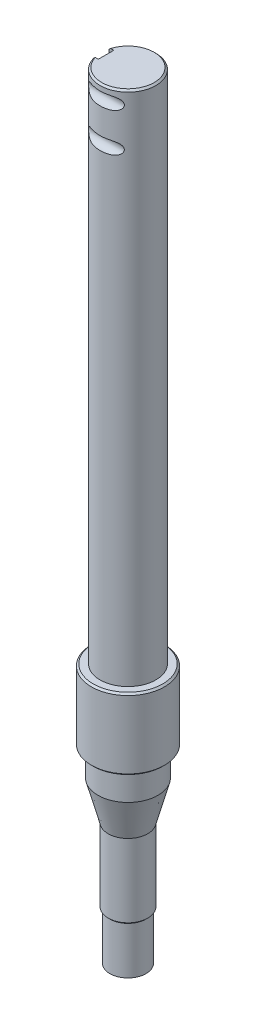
ISO-10303-21;
HEADER;
FILE_DESCRIPTION(('STEP AP214'),'2;1');
FILE_NAME('part.step','',(''),(''),'','','');
FILE_SCHEMA(('AUTOMOTIVE_DESIGN { 1 0 10303 214 1 1 1 1 }'));
ENDSEC;
DATA;
#1=APPLICATION_CONTEXT('core data for automotive mechanical design processes');
#2=APPLICATION_PROTOCOL_DEFINITION('international standard','automotive_design',2000,#1);
#3=PRODUCT_CONTEXT('',#1,'mechanical');
#4=PRODUCT('Part','Part','',(#3));
#5=PRODUCT_RELATED_PRODUCT_CATEGORY('part','',(#4));
#6=PRODUCT_DEFINITION_FORMATION('','',#4);
#7=PRODUCT_DEFINITION_CONTEXT('part definition',#1,'design');
#8=PRODUCT_DEFINITION('design','',#6,#7);
#9=PRODUCT_DEFINITION_SHAPE('','',#8);
#10=(LENGTH_UNIT() NAMED_UNIT(*) SI_UNIT(.MILLI.,.METRE.));
#11=(NAMED_UNIT(*) PLANE_ANGLE_UNIT() SI_UNIT($,.RADIAN.));
#12=(NAMED_UNIT(*) SI_UNIT($,.STERADIAN.) SOLID_ANGLE_UNIT());
#13=UNCERTAINTY_MEASURE_WITH_UNIT(LENGTH_MEASURE(1.E-05),#10,'distance_accuracy_value','');
#14=(GEOMETRIC_REPRESENTATION_CONTEXT(3) GLOBAL_UNCERTAINTY_ASSIGNED_CONTEXT((#13)) GLOBAL_UNIT_ASSIGNED_CONTEXT((#10,
#11,#12)) REPRESENTATION_CONTEXT('',''));
#15=CARTESIAN_POINT('',(0.,0.,0.));
#16=DIRECTION('',(0.,0.,1.));
#17=DIRECTION('',(1.,0.,0.));
#18=AXIS2_PLACEMENT_3D('',#15,#16,#17);
#19=CARTESIAN_POINT('',(0.,301.78,0.));
#20=DIRECTION('',(0.,1.,0.));
#21=DIRECTION('',(0.,0.,1.));
#22=AXIS2_PLACEMENT_3D('',#19,#20,#21);
#23=PLANE('',#22);
#24=CARTESIAN_POINT('',(0.,301.78,0.));
#25=DIRECTION('',(0.,1.,0.));
#26=DIRECTION('',(0.,0.,1.));
#27=AXIS2_PLACEMENT_3D('',#24,#25,#26);
#28=CIRCLE('',#27,40.5);
#29=CARTESIAN_POINT('',(0.,301.78,40.5));
#30=VERTEX_POINT('',#29);
#31=EDGE_CURVE('E142',#30,#30,#28,.T.);
#32=ORIENTED_EDGE('',*,*,#31,.T.);
#33=EDGE_LOOP('',(#32));
#34=FACE_BOUND('',#33,.T.);
#35=CARTESIAN_POINT('',(0.,301.78,0.));
#36=DIRECTION('',(0.,1.,0.));
#37=DIRECTION('',(0.,0.,1.));
#38=AXIS2_PLACEMENT_3D('',#35,#36,#37);
#39=CIRCLE('',#38,32.5);
#40=CARTESIAN_POINT('',(0.,301.78,32.5));
#41=VERTEX_POINT('',#40);
#42=EDGE_CURVE('E120',#41,#41,#39,.T.);
#43=ORIENTED_EDGE('',*,*,#42,.F.);
#44=EDGE_LOOP('',(#43));
#45=FACE_BOUND('',#44,.T.);
#46=ADVANCED_FACE('F36',(#34,#45),#23,.T.);
#47=CARTESIAN_POINT('',(0.,55.,0.));
#48=DIRECTION('',(0.,-1.,0.));
#49=DIRECTION('',(0.,0.,-1.));
#50=AXIS2_PLACEMENT_3D('',#47,#48,#49);
#51=CYLINDRICAL_SURFACE('',#50,21.);
#52=CARTESIAN_POINT('',(0.,55.,0.));
#53=DIRECTION('',(0.,1.,0.));
#54=DIRECTION('',(0.,0.,1.));
#55=AXIS2_PLACEMENT_3D('',#52,#53,#54);
#56=CIRCLE('',#55,21.);
#57=CARTESIAN_POINT('',(0.,55.,21.));
#58=VERTEX_POINT('',#57);
#59=EDGE_CURVE('E134',#58,#58,#56,.T.);
#60=ORIENTED_EDGE('',*,*,#59,.F.);
#61=EDGE_LOOP('',(#60));
#62=FACE_BOUND('',#61,.T.);
#63=CARTESIAN_POINT('',(0.,0.,0.));
#64=DIRECTION('',(0.,1.,0.));
#65=DIRECTION('',(0.,0.,1.));
#66=AXIS2_PLACEMENT_3D('',#63,#64,#65);
#67=CIRCLE('',#66,21.);
#68=CARTESIAN_POINT('',(0.,0.,21.));
#69=VERTEX_POINT('',#68);
#70=EDGE_CURVE('E133',#69,#69,#67,.T.);
#71=ORIENTED_EDGE('',*,*,#70,.T.);
#72=EDGE_LOOP('',(#71));
#73=FACE_BOUND('',#72,.T.);
#74=ADVANCED_FACE('F182',(#62,#73),#51,.T.);
#75=CARTESIAN_POINT('',(0.,0.,0.));
#76=DIRECTION('',(0.,1.,0.));
#77=DIRECTION('',(0.,0.,1.));
#78=AXIS2_PLACEMENT_3D('',#75,#76,#77);
#79=PLANE('',#78);
#80=ORIENTED_EDGE('',*,*,#70,.F.);
#81=EDGE_LOOP('',(#80));
#82=FACE_BOUND('',#81,.T.);
#83=ADVANCED_FACE('F187',(#82),#79,.F.);
#84=CARTESIAN_POINT('',(0.,142.,0.));
#85=DIRECTION('',(0.,-1.,0.));
#86=DIRECTION('',(0.,0.,-1.));
#87=AXIS2_PLACEMENT_3D('',#84,#85,#86);
#88=CYLINDRICAL_SURFACE('',#87,23.);
#89=CARTESIAN_POINT('',(0.,57.,0.));
#90=DIRECTION('',(0.,1.,0.));
#91=DIRECTION('',(0.,0.,1.));
#92=AXIS2_PLACEMENT_3D('',#89,#90,#91);
#93=CIRCLE('',#92,23.);
#94=CARTESIAN_POINT('',(0.,57.,23.));
#95=VERTEX_POINT('',#94);
#96=EDGE_CURVE('E137',#95,#95,#93,.T.);
#97=ORIENTED_EDGE('',*,*,#96,.T.);
#98=EDGE_LOOP('',(#97));
#99=FACE_BOUND('',#98,.T.);
#100=CARTESIAN_POINT('',(0.,142.,0.));
#101=DIRECTION('',(0.,1.,0.));
#102=DIRECTION('',(0.,0.,1.));
#103=AXIS2_PLACEMENT_3D('',#100,#101,#102);
#104=CIRCLE('',#103,23.);
#105=CARTESIAN_POINT('',(0.,142.,23.));
#106=VERTEX_POINT('',#105);
#107=EDGE_CURVE('E130',#106,#106,#104,.T.);
#108=ORIENTED_EDGE('',*,*,#107,.F.);
#109=EDGE_LOOP('',(#108));
#110=FACE_BOUND('',#109,.T.);
#111=ADVANCED_FACE('F210',(#99,#110),#88,.T.);
#112=CARTESIAN_POINT('',(0.,57.,0.));
#113=DIRECTION('',(0.,1.,0.));
#114=DIRECTION('',(0.,0.,1.));
#115=AXIS2_PLACEMENT_3D('',#112,#113,#114);
#116=CONICAL_SURFACE('',#115,23.,0.785398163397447);
#117=ORIENTED_EDGE('',*,*,#59,.T.);
#118=EDGE_LOOP('',(#117));
#119=FACE_BOUND('',#118,.T.);
#120=ORIENTED_EDGE('',*,*,#96,.F.);
#121=EDGE_LOOP('',(#120));
#122=FACE_BOUND('',#121,.T.);
#123=ADVANCED_FACE('F208',(#119,#122),#116,.T.);
#124=CARTESIAN_POINT('',(0.,142.,0.));
#125=DIRECTION('',(0.,1.,0.));
#126=DIRECTION('',(0.,0.,1.));
#127=AXIS2_PLACEMENT_3D('',#124,#125,#126);
#128=CONICAL_SURFACE('',#127,23.,0.26179938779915);
#129=CARTESIAN_POINT('',(0.,186.78,0.));
#130=DIRECTION('',(0.,1.,0.));
#131=DIRECTION('',(0.,0.,1.));
#132=AXIS2_PLACEMENT_3D('',#129,#130,#131);
#133=CIRCLE('',#132,34.9987648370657);
#134=CARTESIAN_POINT('',(0.,186.78,34.9987648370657));
#135=VERTEX_POINT('',#134);
#136=EDGE_CURVE('E127',#135,#135,#133,.T.);
#137=ORIENTED_EDGE('',*,*,#136,.F.);
#138=EDGE_LOOP('',(#137));
#139=FACE_BOUND('',#138,.T.);
#140=ORIENTED_EDGE('',*,*,#107,.T.);
#141=EDGE_LOOP('',(#140));
#142=FACE_BOUND('',#141,.T.);
#143=ADVANCED_FACE('F204',(#139,#142),#128,.T.);
#144=CARTESIAN_POINT('',(0.,218.78,0.));
#145=DIRECTION('',(0.,-1.,0.));
#146=DIRECTION('',(0.,0.,-1.));
#147=AXIS2_PLACEMENT_3D('',#144,#145,#146);
#148=CYLINDRICAL_SURFACE('',#147,34.9987648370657);
#149=CARTESIAN_POINT('',(0.,218.78,0.));
#150=DIRECTION('',(0.,1.,0.));
#151=DIRECTION('',(0.,0.,1.));
#152=AXIS2_PLACEMENT_3D('',#149,#150,#151);
#153=CIRCLE('',#152,34.9987648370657);
#154=CARTESIAN_POINT('',(0.,218.78,34.9987648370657));
#155=VERTEX_POINT('',#154);
#156=EDGE_CURVE('E123',#155,#155,#153,.T.);
#157=ORIENTED_EDGE('',*,*,#156,.F.);
#158=EDGE_LOOP('',(#157));
#159=FACE_BOUND('',#158,.T.);
#160=ORIENTED_EDGE('',*,*,#136,.T.);
#161=EDGE_LOOP('',(#160));
#162=FACE_BOUND('',#161,.T.);
#163=ADVANCED_FACE('F196',(#159,#162),#148,.T.);
#164=CARTESIAN_POINT('',(0.,218.78,0.));
#165=DIRECTION('',(0.,1.,0.));
#166=DIRECTION('',(0.,0.,1.));
#167=AXIS2_PLACEMENT_3D('',#164,#165,#166);
#168=PLANE('',#167);
#169=CARTESIAN_POINT('',(0.,218.78,0.));
#170=DIRECTION('',(0.,1.,0.));
#171=DIRECTION('',(0.,0.,1.));
#172=AXIS2_PLACEMENT_3D('',#169,#170,#171);
#173=CIRCLE('',#172,40.5);
#174=CARTESIAN_POINT('',(0.,218.78,40.5));
#175=VERTEX_POINT('',#174);
#176=EDGE_CURVE('E151',#175,#175,#173,.F.);
#177=ORIENTED_EDGE('',*,*,#176,.T.);
#178=EDGE_LOOP('',(#177));
#179=FACE_BOUND('',#178,.T.);
#180=ORIENTED_EDGE('',*,*,#156,.T.);
#181=EDGE_LOOP('',(#180));
#182=FACE_BOUND('',#181,.T.);
#183=ADVANCED_FACE('F192',(#179,#182),#168,.F.);
#184=CARTESIAN_POINT('',(0.,301.78,0.));
#185=DIRECTION('',(0.,-1.,0.));
#186=DIRECTION('',(0.,0.,-1.));
#187=AXIS2_PLACEMENT_3D('',#184,#185,#186);
#188=CYLINDRICAL_SURFACE('',#187,42.5);
#189=CARTESIAN_POINT('',(0.,299.78,0.));
#190=DIRECTION('',(0.,1.,0.));
#191=DIRECTION('',(0.,0.,1.));
#192=AXIS2_PLACEMENT_3D('',#189,#190,#191);
#193=CIRCLE('',#192,42.5);
#194=CARTESIAN_POINT('',(0.,299.78,42.5));
#195=VERTEX_POINT('',#194);
#196=EDGE_CURVE('E148',#195,#195,#193,.F.);
#197=ORIENTED_EDGE('',*,*,#196,.T.);
#198=EDGE_LOOP('',(#197));
#199=FACE_BOUND('',#198,.T.);
#200=CARTESIAN_POINT('',(0.,220.78,0.));
#201=DIRECTION('',(0.,1.,0.));
#202=DIRECTION('',(0.,0.,1.));
#203=AXIS2_PLACEMENT_3D('',#200,#201,#202);
#204=CIRCLE('',#203,42.5);
#205=CARTESIAN_POINT('',(0.,220.78,42.5));
#206=VERTEX_POINT('',#205);
#207=EDGE_CURVE('E145',#206,#206,#204,.T.);
#208=ORIENTED_EDGE('',*,*,#207,.T.);
#209=EDGE_LOOP('',(#208));
#210=FACE_BOUND('',#209,.T.);
#211=ADVANCED_FACE('F195',(#199,#210),#188,.T.);
#212=CARTESIAN_POINT('',(0.,301.78,0.));
#213=DIRECTION('',(0.,-1.,0.));
#214=DIRECTION('',(0.,0.,-1.));
#215=AXIS2_PLACEMENT_3D('',#212,#213,#214);
#216=CONICAL_SURFACE('',#215,40.5,0.785398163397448);
#217=ORIENTED_EDGE('',*,*,#196,.F.);
#218=EDGE_LOOP('',(#217));
#219=FACE_BOUND('',#218,.T.);
#220=ORIENTED_EDGE('',*,*,#31,.F.);
#221=EDGE_LOOP('',(#220));
#222=FACE_BOUND('',#221,.T.);
#223=ADVANCED_FACE('F200',(#219,#222),#216,.T.);
#224=CARTESIAN_POINT('',(0.,220.78,0.));
#225=DIRECTION('',(0.,1.,0.));
#226=DIRECTION('',(0.,0.,1.));
#227=AXIS2_PLACEMENT_3D('',#224,#225,#226);
#228=CONICAL_SURFACE('',#227,42.5,0.785398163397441);
#229=ORIENTED_EDGE('',*,*,#176,.F.);
#230=EDGE_LOOP('',(#229));
#231=FACE_BOUND('',#230,.T.);
#232=ORIENTED_EDGE('',*,*,#207,.F.);
#233=EDGE_LOOP('',(#232));
#234=FACE_BOUND('',#233,.T.);
#235=ADVANCED_FACE('F180',(#231,#234),#228,.T.);
#236=CARTESIAN_POINT('',(0.,902.78,0.));
#237=DIRECTION('',(0.,-1.,0.));
#238=DIRECTION('',(0.,0.,-1.));
#239=AXIS2_PLACEMENT_3D('',#236,#237,#238);
#240=CYLINDRICAL_SURFACE('',#239,32.5);
#241=CARTESIAN_POINT('',(0.,900.78,0.));
#242=DIRECTION('',(0.,1.,0.));
#243=DIRECTION('',(0.,0.,1.));
#244=AXIS2_PLACEMENT_3D('',#241,#242,#243);
#245=CIRCLE('',#244,32.5);
#246=CARTESIAN_POINT('',(-31.2289929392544,900.78,-9.));
#247=VERTEX_POINT('',#246);
#248=CARTESIAN_POINT('',(-31.2289929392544,900.78,9.));
#249=VERTEX_POINT('',#248);
#250=EDGE_CURVE('E273',#247,#249,#245,.F.);
#251=ORIENTED_EDGE('',*,*,#250,.T.);
#252=DIRECTION('',(0.,-1.,0.));
#253=VECTOR('',#252,1.);
#254=CARTESIAN_POINT('',(-31.2289929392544,902.78,9.));
#255=LINE('',#254,#253);
#256=CARTESIAN_POINT('',(-31.2289929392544,846.78,9.));
#257=VERTEX_POINT('',#256);
#258=EDGE_CURVE('E117',#249,#257,#255,.T.);
#259=ORIENTED_EDGE('',*,*,#258,.T.);
#260=CARTESIAN_POINT('',(-31.2289929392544,846.78,9.));
#261=CARTESIAN_POINT('',(-31.2289606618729,846.532073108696,9.00003254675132));
#262=CARTESIAN_POINT('',(-31.2319442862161,846.284157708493,8.98975684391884));
#263=CARTESIAN_POINT('',(-31.2437080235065,845.790200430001,8.94882917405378));
#264=CARTESIAN_POINT('',(-31.2524869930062,845.544158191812,8.91818122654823));
#265=CARTESIAN_POINT('',(-31.2755793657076,845.056267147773,8.8368439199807));
#266=CARTESIAN_POINT('',(-31.2898798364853,844.814409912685,8.78620138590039));
#267=CARTESIAN_POINT('',(-31.3235726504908,844.336005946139,8.66531911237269));
#268=CARTESIAN_POINT('',(-31.3429650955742,844.099459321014,8.59507898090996));
#269=CARTESIAN_POINT('',(-31.3862589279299,843.6334018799,8.43561253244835));
#270=CARTESIAN_POINT('',(-31.410158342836,843.40388803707,8.3463945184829));
#271=CARTESIAN_POINT('',(-31.4617886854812,842.953215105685,8.1496133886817));
#272=CARTESIAN_POINT('',(-31.4895210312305,842.732059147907,8.042043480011));
#273=CARTESIAN_POINT('',(-31.5480332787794,842.299561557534,7.80935225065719));
#274=CARTESIAN_POINT('',(-31.5788136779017,842.088221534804,7.68422806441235));
#275=CARTESIAN_POINT('',(-31.6425731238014,841.676690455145,7.41730334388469));
#276=CARTESIAN_POINT('',(-31.6755522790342,841.47649994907,7.27550198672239));
#277=CARTESIAN_POINT('',(-31.7436360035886,841.083797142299,6.97253545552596));
#278=CARTESIAN_POINT('',(-31.7787726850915,840.891587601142,6.81098493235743));
#279=CARTESIAN_POINT('',(-31.8494496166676,840.521368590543,6.47243807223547));
#280=CARTESIAN_POINT('',(-31.8849898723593,840.343359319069,6.29544152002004));
#281=CARTESIAN_POINT('',(-31.9555100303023,840.002654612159,5.92710208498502));
#282=CARTESIAN_POINT('',(-31.990489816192,839.839962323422,5.73575626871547));
#283=CARTESIAN_POINT('',(-32.0589301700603,839.531020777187,5.33997392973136));
#284=CARTESIAN_POINT('',(-32.0923907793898,839.384771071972,5.13553776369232));
#285=CARTESIAN_POINT('',(-32.1574631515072,839.107258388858,4.71110043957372));
#286=CARTESIAN_POINT('',(-32.1890310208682,838.976311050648,4.49088596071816));
#287=CARTESIAN_POINT('',(-32.2487457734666,838.733544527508,4.03981868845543));
#288=CARTESIAN_POINT('',(-32.2768939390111,838.621718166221,3.80896992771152));
#289=CARTESIAN_POINT('',(-32.3289656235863,838.418079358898,3.33826102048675));
#290=CARTESIAN_POINT('',(-32.3528911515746,838.326257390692,3.0984052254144));
#291=CARTESIAN_POINT('',(-32.3958369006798,838.163365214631,2.61142976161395));
#292=CARTESIAN_POINT('',(-32.4148583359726,838.092289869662,2.36431190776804));
#293=CARTESIAN_POINT('',(-32.4536610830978,837.948423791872,1.76898298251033));
#294=CARTESIAN_POINT('',(-32.4709620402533,837.885330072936,1.41818254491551));
#295=CARTESIAN_POINT('',(-32.4883408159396,837.822174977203,0.888308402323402));
#296=CARTESIAN_POINT('',(-32.4927049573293,837.806370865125,0.711087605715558));
#297=CARTESIAN_POINT('',(-32.4985365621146,837.785282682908,0.355929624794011));
#298=CARTESIAN_POINT('',(-32.5000033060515,837.780001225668,0.177992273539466));
#299=CARTESIAN_POINT('',(-32.5,837.78,0.));
#300=B_SPLINE_CURVE_WITH_KNOTS('',3,(#260,#261,#262,#263,#264,#265,#266,#267,#268,#269,#270,
#271,#272,#273,#274,#275,#276,#277,#278,#279,#280,#281,#282,#283,#284,#285,#286,#287,#288,#289,
#290,#291,#292,#293,#294,#295,#296,#297,#298,#299),.UNSPECIFIED.,.F.,.F.,(4,2,2,2,2,2,2,2,2,2,2,
2,2,2,2,2,2,2,2,4),(0.,0.743532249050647,1.48691783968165,2.22857273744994,2.97024247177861,
3.71158838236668,4.45320929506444,5.1949514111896,5.93673014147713,6.69644741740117,
7.45617528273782,8.21605888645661,8.97592179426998,9.74940568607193,10.5225986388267,
11.2954227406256,12.0680553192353,13.1355497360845,13.6692005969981,14.2029839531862),.UNSPECIFIED.);
#301=CARTESIAN_POINT('',(-32.5,837.78,0.));
#302=VERTEX_POINT('',#301);
#303=EDGE_CURVE('E46',#257,#302,#300,.T.);
#304=ORIENTED_EDGE('',*,*,#303,.T.);
#305=CARTESIAN_POINT('',(-32.5,837.78,0.));
#306=CARTESIAN_POINT('',(-32.5000278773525,837.779967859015,-0.248111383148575));
#307=CARTESIAN_POINT('',(-32.4971597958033,837.790258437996,-0.496212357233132));
#308=CARTESIAN_POINT('',(-32.48583439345,837.831248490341,-0.990551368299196));
#309=CARTESIAN_POINT('',(-32.4773780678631,837.861944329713,-1.23678972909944));
#310=CARTESIAN_POINT('',(-32.4551033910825,837.943418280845,-1.72511021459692));
#311=CARTESIAN_POINT('',(-32.4412969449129,837.994151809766,-1.96720032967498));
#312=CARTESIAN_POINT('',(-32.4087070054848,838.115260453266,-2.44607369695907));
#313=CARTESIAN_POINT('',(-32.389923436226,838.185635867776,-2.68285686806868));
#314=CARTESIAN_POINT('',(-32.3478919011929,838.345425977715,-3.14940387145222));
#315=CARTESIAN_POINT('',(-32.3246454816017,838.43483408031,-3.37917010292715));
#316=CARTESIAN_POINT('',(-32.2742952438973,838.632041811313,-3.83032760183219));
#317=CARTESIAN_POINT('',(-32.2471900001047,838.739848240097,-4.05171573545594));
#318=CARTESIAN_POINT('',(-32.1898397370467,838.973044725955,-4.48463000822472));
#319=CARTESIAN_POINT('',(-32.1595943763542,839.098436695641,-4.69615507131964));
#320=CARTESIAN_POINT('',(-32.0967546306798,839.365921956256,-5.10800793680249));
#321=CARTESIAN_POINT('',(-32.0641601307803,839.508016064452,-5.30833519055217));
#322=CARTESIAN_POINT('',(-31.9967296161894,839.811281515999,-5.70086205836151));
#323=CARTESIAN_POINT('',(-31.9618599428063,839.972805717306,-5.89278334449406));
#324=CARTESIAN_POINT('',(-31.8914954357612,840.311238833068,-6.26242158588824));
#325=CARTESIAN_POINT('',(-31.8560005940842,840.488147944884,-6.44013835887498));
#326=CARTESIAN_POINT('',(-31.785344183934,840.856256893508,-6.78027142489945));
#327=CARTESIAN_POINT('',(-31.7501827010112,841.047460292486,-6.94268388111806));
#328=CARTESIAN_POINT('',(-31.6811734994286,841.442898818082,-7.25108413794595));
#329=CARTESIAN_POINT('',(-31.6473257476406,841.647133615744,-7.39707235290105));
#330=CARTESIAN_POINT('',(-31.5812634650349,842.071397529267,-7.67427509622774));
#331=CARTESIAN_POINT('',(-31.5490929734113,842.291655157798,-7.80515073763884));
#332=CARTESIAN_POINT('',(-31.48807793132,842.74279995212,-8.04776963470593));
#333=CARTESIAN_POINT('',(-31.4592321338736,842.973683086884,-8.1595200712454));
#334=CARTESIAN_POINT('',(-31.4057520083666,843.444452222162,-8.36300300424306));
#335=CARTESIAN_POINT('',(-31.3811154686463,843.684333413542,-8.45474602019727));
#336=CARTESIAN_POINT('',(-31.3368165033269,844.171370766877,-8.61748315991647));
#337=CARTESIAN_POINT('',(-31.3171528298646,844.418525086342,-8.68848248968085));
#338=CARTESIAN_POINT('',(-31.2770342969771,845.013399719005,-8.83203134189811));
#339=CARTESIAN_POINT('',(-31.2591096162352,845.363699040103,-8.89494949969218));
#340=CARTESIAN_POINT('',(-31.2410917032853,845.892843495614,-8.95793444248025));
#341=CARTESIAN_POINT('',(-31.2365639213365,846.06983263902,-8.97369737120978));
#342=CARTESIAN_POINT('',(-31.2305120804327,846.42452942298,-8.99473093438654));
#343=CARTESIAN_POINT('',(-31.2289887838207,846.602237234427,-8.99999890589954));
#344=CARTESIAN_POINT('',(-31.2289929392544,846.78,-9.));
#345=B_SPLINE_CURVE_WITH_KNOTS('',3,(#305,#306,#307,#308,#309,#310,#311,#312,#313,#314,#315,
#316,#317,#318,#319,#320,#321,#322,#323,#324,#325,#326,#327,#328,#329,#330,#331,#332,#333,#334,
#335,#336,#337,#338,#339,#340,#341,#342,#343,#344),.UNSPECIFIED.,.F.,.F.,(4,2,2,2,2,2,2,2,2,2,2,
2,2,2,2,2,2,2,2,4),(0.,0.744088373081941,1.48804426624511,2.23035413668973,2.97267534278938,
3.71473982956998,4.45707919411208,5.19949935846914,5.94195586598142,6.70085846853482,
7.45977080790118,8.21887290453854,8.97795584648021,9.75166586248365,10.525084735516,
11.2980959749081,12.0709130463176,13.1369303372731,13.6698897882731,14.202984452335),.UNSPECIFIED.);
#346=CARTESIAN_POINT('',(-31.2289929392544,846.78,-9.));
#347=VERTEX_POINT('',#346);
#348=EDGE_CURVE('E11',#302,#347,#345,.T.);
#349=ORIENTED_EDGE('',*,*,#348,.T.);
#350=DIRECTION('',(0.,-1.,0.));
#351=VECTOR('',#350,1.);
#352=CARTESIAN_POINT('',(-31.2289929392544,902.78,-9.));
#353=LINE('',#352,#351);
#354=EDGE_CURVE('E114',#347,#247,#353,.F.);
#355=ORIENTED_EDGE('',*,*,#354,.T.);
#356=EDGE_LOOP('',(#251,#259,#304,#349,#355));
#357=FACE_BOUND('',#356,.T.);
#358=CARTESIAN_POINT('',(-2.2694641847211E-13,850.28,32.5));
#359=CARTESIAN_POINT('',(0.453658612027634,850.280001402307,32.4999997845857));
#360=CARTESIAN_POINT('',(0.907326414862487,850.280018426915,32.4904995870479));
#361=CARTESIAN_POINT('',(1.81387717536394,850.279873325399,32.4525142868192));
#362=CARTESIAN_POINT('',(2.26676010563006,850.279711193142,32.4240285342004));
#363=CARTESIAN_POINT('',(3.17112711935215,850.278557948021,32.3481057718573));
#364=CARTESIAN_POINT('',(3.62261053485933,850.277566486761,32.3006608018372));
#365=CARTESIAN_POINT('',(4.52317849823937,850.273677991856,32.1869048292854));
#366=CARTESIAN_POINT('',(4.97226309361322,850.270780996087,32.1205942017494));
#367=CARTESIAN_POINT('',(5.86618687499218,850.261590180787,31.9694050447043));
#368=CARTESIAN_POINT('',(6.31103352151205,850.255304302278,31.8845701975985));
#369=CARTESIAN_POINT('',(7.19672624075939,850.237423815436,31.6964051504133));
#370=CARTESIAN_POINT('',(7.63757207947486,850.225828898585,31.5930738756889));
#371=CARTESIAN_POINT('',(8.51399477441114,850.19498379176,31.3682387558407));
#372=CARTESIAN_POINT('',(8.94957532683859,850.175739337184,31.246748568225));
#373=CARTESIAN_POINT('',(9.8146963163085,850.126775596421,30.985896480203));
#374=CARTESIAN_POINT('',(10.2442378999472,850.097058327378,30.8465380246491));
#375=CARTESIAN_POINT('',(11.0360582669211,850.028953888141,30.5713179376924));
#376=CARTESIAN_POINT('',(11.3992832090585,849.992379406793,30.4377326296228));
#377=CARTESIAN_POINT('',(12.1194229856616,849.906534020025,30.1582281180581));
#378=CARTESIAN_POINT('',(12.4763384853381,849.857264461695,30.012310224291));
#379=CARTESIAN_POINT('',(13.1834597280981,849.743038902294,29.708496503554));
#380=CARTESIAN_POINT('',(13.5336492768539,849.67804918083,29.550575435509));
#381=CARTESIAN_POINT('',(14.2249655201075,849.529111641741,29.2240730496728));
#382=CARTESIAN_POINT('',(14.5660924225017,849.445164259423,29.0554919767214));
#383=CARTESIAN_POINT('',(15.2426258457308,849.252960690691,28.7064362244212));
#384=CARTESIAN_POINT('',(15.5778541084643,849.144337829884,28.5258146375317));
#385=CARTESIAN_POINT('',(16.2341743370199,848.898941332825,28.1574707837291));
#386=CARTESIAN_POINT('',(16.5552601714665,848.762155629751,27.9697455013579));
#387=CARTESIAN_POINT('',(17.1776218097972,848.456181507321,27.5918660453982));
#388=CARTESIAN_POINT('',(17.4789928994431,848.287167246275,27.4017298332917));
#389=CARTESIAN_POINT('',(18.0581609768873,847.911216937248,27.0235464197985));
#390=CARTESIAN_POINT('',(18.3359922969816,847.704337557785,26.83549653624));
#391=CARTESIAN_POINT('',(18.8382413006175,847.267901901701,26.4850166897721));
#392=CARTESIAN_POINT('',(19.0652086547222,847.041953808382,26.3217897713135));
#393=CARTESIAN_POINT('',(19.4872095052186,846.551688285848,26.010906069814));
#394=CARTESIAN_POINT('',(19.6822397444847,846.287366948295,25.8632508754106));
#395=CARTESIAN_POINT('',(19.9451705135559,845.861266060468,25.6603349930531));
#396=CARTESIAN_POINT('',(20.0282963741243,845.713292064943,25.5954501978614));
#397=CARTESIAN_POINT('',(20.1829267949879,845.408296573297,25.4736944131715));
#398=CARTESIAN_POINT('',(20.2544381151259,845.251280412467,25.4168187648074));
#399=CARTESIAN_POINT('',(20.3846324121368,844.929137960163,25.3125213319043));
#400=CARTESIAN_POINT('',(20.443325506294,844.764018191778,25.26509209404));
#401=CARTESIAN_POINT('',(20.5468460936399,844.426832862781,25.18097645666));
#402=CARTESIAN_POINT('',(20.5916764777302,844.254768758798,25.1442878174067));
#403=CARTESIAN_POINT('',(20.6616220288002,843.928343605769,25.0868320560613));
#404=CARTESIAN_POINT('',(20.6885534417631,843.774626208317,25.064606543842));
#405=CARTESIAN_POINT('',(20.7308008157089,843.464531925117,25.0296754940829));
#406=CARTESIAN_POINT('',(20.7461177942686,843.308155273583,25.0169691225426));
#407=CARTESIAN_POINT('',(20.7648582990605,842.994286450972,25.0014161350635));
#408=CARTESIAN_POINT('',(20.7682881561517,842.836794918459,24.9985642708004));
#409=CARTESIAN_POINT('',(20.7632088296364,842.522145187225,25.0027832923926));
#410=CARTESIAN_POINT('',(20.7547007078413,842.364986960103,25.0098532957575));
#411=CARTESIAN_POINT('',(20.7278456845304,842.07355977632,25.0321126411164));
#412=CARTESIAN_POINT('',(20.7109770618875,841.939056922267,25.0460811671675));
#413=CARTESIAN_POINT('',(20.6686379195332,841.6722937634,25.0810318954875));
#414=CARTESIAN_POINT('',(20.6431646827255,841.540034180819,25.1020163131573));
#415=CARTESIAN_POINT('',(20.583947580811,841.278687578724,25.1505976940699));
#416=CARTESIAN_POINT('',(20.5502075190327,841.149599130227,25.1781916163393));
#417=CARTESIAN_POINT('',(20.4748517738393,840.89521419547,25.2395087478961));
#418=CARTESIAN_POINT('',(20.4332331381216,840.769919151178,25.2732342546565));
#419=CARTESIAN_POINT('',(20.2936265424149,840.390918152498,25.3856924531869));
#420=CARTESIAN_POINT('',(20.1832387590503,840.144396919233,25.4737493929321));
#421=CARTESIAN_POINT('',(19.9347964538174,839.673963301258,25.6686327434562));
#422=CARTESIAN_POINT('',(19.7967279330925,839.450062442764,25.7754686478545));
#423=CARTESIAN_POINT('',(19.5319833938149,839.075047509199,25.9763845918));
#424=CARTESIAN_POINT('',(19.4100285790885,838.91905872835,26.0677205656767));
#425=CARTESIAN_POINT('',(19.1541615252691,838.620992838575,26.2563010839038));
#426=CARTESIAN_POINT('',(19.020244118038,838.478921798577,26.3535481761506));
#427=CARTESIAN_POINT('',(18.7418990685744,838.208107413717,26.5522222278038));
#428=CARTESIAN_POINT('',(18.5974532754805,838.079388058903,26.6536562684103));
#429=CARTESIAN_POINT('',(18.2996453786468,837.834842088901,26.8589974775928));
#430=CARTESIAN_POINT('',(18.1462802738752,837.719019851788,26.9629054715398));
#431=CARTESIAN_POINT('',(17.7460919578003,837.439583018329,27.2288658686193));
#432=CARTESIAN_POINT('',(17.4939218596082,837.284360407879,27.3917179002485));
#433=CARTESIAN_POINT('',(16.9748607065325,836.999542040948,27.7163852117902));
#434=CARTESIAN_POINT('',(16.7079612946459,836.869961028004,27.8781998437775));
#435=CARTESIAN_POINT('',(16.1618974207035,836.633052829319,28.1982871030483));
#436=CARTESIAN_POINT('',(15.8827151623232,836.525759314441,28.3565540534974));
#437=CARTESIAN_POINT('',(15.314640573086,836.330626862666,28.6673444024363));
#438=CARTESIAN_POINT('',(15.0257491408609,836.242786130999,28.8198683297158));
#439=CARTESIAN_POINT('',(14.4712092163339,836.092279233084,29.1018950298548));
#440=CARTESIAN_POINT('',(14.2063769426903,836.027925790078,29.2321158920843));
#441=CARTESIAN_POINT('',(13.6711477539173,835.910739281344,29.4862255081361));
#442=CARTESIAN_POINT('',(13.4007499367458,835.857908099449,29.6101132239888));
#443=CARTESIAN_POINT('',(12.8550415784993,835.762163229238,29.8510792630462));
#444=CARTESIAN_POINT('',(12.5797283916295,835.71925506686,29.9681537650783));
#445=CARTESIAN_POINT('',(12.0249231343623,835.641963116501,30.1950502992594));
#446=CARTESIAN_POINT('',(11.7454305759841,835.60758033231,30.3048714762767));
#447=CARTESIAN_POINT('',(11.1822630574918,835.546008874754,30.5171711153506));
#448=CARTESIAN_POINT('',(10.8985809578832,835.518834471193,30.6196347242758));
#449=CARTESIAN_POINT('',(10.3279882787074,835.470618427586,30.8167775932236));
#450=CARTESIAN_POINT('',(10.0410774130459,835.449577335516,30.9114561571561));
#451=CARTESIAN_POINT('',(9.46449527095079,835.412608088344,31.0928391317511));
#452=CARTESIAN_POINT('',(9.17482463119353,835.396678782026,31.179545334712));
#453=CARTESIAN_POINT('',(8.59298727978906,835.369012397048,31.3448887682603));
#454=CARTESIAN_POINT('',(8.30082046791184,835.357275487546,31.423525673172));
#455=CARTESIAN_POINT('',(7.57028824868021,835.332237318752,31.6092432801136));
#456=CARTESIAN_POINT('',(7.13057387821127,835.320997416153,31.7113324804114));
#457=CARTESIAN_POINT('',(6.24716142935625,835.303688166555,31.8971276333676));
#458=CARTESIAN_POINT('',(5.80346303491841,835.297619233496,31.9808321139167));
#459=CARTESIAN_POINT('',(4.91277581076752,835.288774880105,32.1297147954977));
#460=CARTESIAN_POINT('',(4.4657858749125,835.286000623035,32.1948864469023));
#461=CARTESIAN_POINT('',(3.56948410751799,835.282287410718,32.3065432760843));
#462=CARTESIAN_POINT('',(3.12017233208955,835.281348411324,32.3530289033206));
#463=CARTESIAN_POINT('',(2.21939047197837,835.280260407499,32.4272850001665));
#464=CARTESIAN_POINT('',(1.76791828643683,835.280112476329,32.455029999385));
#465=CARTESIAN_POINT('',(0.86420707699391,835.279982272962,32.4916551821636));
#466=CARTESIAN_POINT('',(0.411968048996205,835.280000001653,32.5005352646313));
#467=CARTESIAN_POINT('',(-0.492381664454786,835.279999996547,32.499414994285));
#468=CARTESIAN_POINT('',(-0.944492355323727,835.279982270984,32.4894190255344));
#469=CARTESIAN_POINT('',(-1.84790218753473,835.280137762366,32.4505727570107));
#470=CARTESIAN_POINT('',(-2.29920132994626,835.280310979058,32.4217224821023));
#471=CARTESIAN_POINT('',(-3.20374923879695,835.281504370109,32.3449166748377));
#472=CARTESIAN_POINT('',(-3.65698539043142,835.282531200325,32.2968125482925));
#473=CARTESIAN_POINT('',(-4.56103244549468,835.286540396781,32.18158835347));
#474=CARTESIAN_POINT('',(-5.01184332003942,835.28952278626,32.1144680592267));
#475=CARTESIAN_POINT('',(-5.91050505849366,835.298978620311,31.9612863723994));
#476=CARTESIAN_POINT('',(-6.3583538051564,835.305454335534,31.8752126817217));
#477=CARTESIAN_POINT('',(-7.24992323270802,835.323870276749,31.6843247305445));
#478=CARTESIAN_POINT('',(-7.6936440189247,835.335810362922,31.5795109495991));
#479=CARTESIAN_POINT('',(-8.57378329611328,835.367500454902,31.3519661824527));
#480=CARTESIAN_POINT('',(-9.01022748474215,835.38721032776,31.229329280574));
#481=CARTESIAN_POINT('',(-9.87711886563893,835.437314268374,30.966073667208));
#482=CARTESIAN_POINT('',(-10.3075653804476,835.467709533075,30.8254529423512));
#483=CARTESIAN_POINT('',(-11.1605340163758,835.542540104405,30.526977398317));
#484=CARTESIAN_POINT('',(-11.5830666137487,835.586955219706,30.3691475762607));
#485=CARTESIAN_POINT('',(-12.4191554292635,835.693835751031,30.0369227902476));
#486=CARTESIAN_POINT('',(-12.8327150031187,835.756294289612,29.8625341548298));
#487=CARTESIAN_POINT('',(-13.4919812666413,835.875618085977,29.5684322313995));
#488=CARTESIAN_POINT('',(-13.7411032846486,835.925404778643,29.4534691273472));
#489=CARTESIAN_POINT('',(-14.234588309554,836.034897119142,29.218165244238));
#490=CARTESIAN_POINT('',(-14.4789516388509,836.094602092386,29.0978248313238));
#491=CARTESIAN_POINT('',(-14.9623895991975,836.225379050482,28.8522176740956));
#492=CARTESIAN_POINT('',(-15.2014596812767,836.296460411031,28.7269469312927));
#493=CARTESIAN_POINT('',(-15.6731967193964,836.451494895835,28.4723152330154));
#494=CARTESIAN_POINT('',(-15.9058636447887,836.535448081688,28.3429542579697));
#495=CARTESIAN_POINT('',(-16.3656307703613,836.718682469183,28.0800078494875));
#496=CARTESIAN_POINT('',(-16.592666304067,836.818088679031,27.9463957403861));
#497=CARTESIAN_POINT('',(-17.0376786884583,837.03355299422,27.677339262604));
#498=CARTESIAN_POINT('',(-17.2556542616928,837.1496134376,27.5418946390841));
#499=CARTESIAN_POINT('',(-17.6804153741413,837.40011140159,27.2711607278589));
#500=CARTESIAN_POINT('',(-17.8872170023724,837.534521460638,27.1358715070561));
#501=CARTESIAN_POINT('',(-18.2876244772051,837.823637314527,26.8676547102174));
#502=CARTESIAN_POINT('',(-18.4812370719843,837.978332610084,26.7347259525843));
#503=CARTESIAN_POINT('',(-18.907808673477,838.358960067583,26.4354128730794));
#504=CARTESIAN_POINT('',(-19.1354146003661,838.592414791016,26.2707940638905));
#505=CARTESIAN_POINT('',(-19.5564830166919,839.098764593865,25.9588628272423));
#506=CARTESIAN_POINT('',(-19.7499851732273,839.37161317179,25.8115303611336));
#507=CARTESIAN_POINT('',(-19.9944391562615,839.786677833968,25.6218846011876));
#508=CARTESIAN_POINT('',(-20.0632045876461,839.913394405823,25.5680389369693));
#509=CARTESIAN_POINT('',(-20.1923158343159,840.173271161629,25.4661954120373));
#510=CARTESIAN_POINT('',(-20.2526656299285,840.306428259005,25.4181947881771));
#511=CARTESIAN_POINT('',(-20.3642513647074,840.578718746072,25.3288844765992));
#512=CARTESIAN_POINT('',(-20.4154854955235,840.717853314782,25.2875761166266));
#513=CARTESIAN_POINT('',(-20.5081274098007,841.001278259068,25.2125021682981));
#514=CARTESIAN_POINT('',(-20.5495395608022,841.145566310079,25.1787332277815));
#515=CARTESIAN_POINT('',(-20.6222135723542,841.439438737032,25.1192462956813));
#516=CARTESIAN_POINT('',(-20.6534016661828,841.589053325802,25.0935868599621));
#517=CARTESIAN_POINT('',(-20.7047229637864,841.891431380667,25.0512586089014));
#518=CARTESIAN_POINT('',(-20.7248560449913,842.044194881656,25.0345898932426));
#519=CARTESIAN_POINT('',(-20.7537190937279,842.351468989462,25.0106676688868));
#520=CARTESIAN_POINT('',(-20.7624536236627,842.505978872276,25.0034103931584));
#521=CARTESIAN_POINT('',(-20.7683798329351,842.815364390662,24.9984882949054));
#522=CARTESIAN_POINT('',(-20.7655726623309,842.970239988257,25.000822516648));
#523=CARTESIAN_POINT('',(-20.7494546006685,843.261156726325,25.0142003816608));
#524=CARTESIAN_POINT('',(-20.7373877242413,843.397317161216,25.0242124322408));
#525=CARTESIAN_POINT('',(-20.7044170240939,843.667871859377,25.0514984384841));
#526=CARTESIAN_POINT('',(-20.683510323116,843.802265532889,25.0687747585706));
#527=CARTESIAN_POINT('',(-20.6331400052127,844.068287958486,25.110248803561));
#528=CARTESIAN_POINT('',(-20.6036802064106,844.199917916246,25.1344434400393));
#529=CARTESIAN_POINT('',(-20.5365684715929,844.459714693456,25.1893077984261));
#530=CARTESIAN_POINT('',(-20.4989133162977,844.587880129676,25.2199800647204));
#531=CARTESIAN_POINT('',(-20.3726581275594,844.971031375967,25.3222574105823));
#532=CARTESIAN_POINT('',(-20.2717448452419,845.219585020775,25.403306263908));
#533=CARTESIAN_POINT('',(-20.041798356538,845.695358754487,25.5851064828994));
#534=CARTESIAN_POINT('',(-19.9127521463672,845.922568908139,25.6858669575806));
#535=CARTESIAN_POINT('',(-19.6662435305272,846.29991232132,25.8748259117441));
#536=CARTESIAN_POINT('',(-19.5539693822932,846.455101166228,25.959853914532));
#537=CARTESIAN_POINT('',(-19.3177363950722,846.752519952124,26.1361199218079));
#538=CARTESIAN_POINT('',(-19.1937760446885,846.894748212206,26.2273587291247));
#539=CARTESIAN_POINT('',(-18.9354628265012,847.1667440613,26.4144606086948));
#540=CARTESIAN_POINT('',(-18.801089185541,847.296485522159,26.5103327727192));
#541=CARTESIAN_POINT('',(-18.5235621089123,847.543673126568,26.7049883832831));
#542=CARTESIAN_POINT('',(-18.380410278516,847.66112150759,26.8037712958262));
#543=CARTESIAN_POINT('',(-18.0100264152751,847.942503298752,27.0547890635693));
#544=CARTESIAN_POINT('',(-17.7777676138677,848.098866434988,27.2081181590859));
#545=CARTESIAN_POINT('',(-17.2989291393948,848.387558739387,27.5150519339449));
#546=CARTESIAN_POINT('',(-17.0523417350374,848.519874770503,27.6686567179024));
#547=CARTESIAN_POINT('',(-16.5471570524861,848.763384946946,27.9737163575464));
#548=CARTESIAN_POINT('',(-16.2885419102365,848.874546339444,28.1251675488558));
#549=CARTESIAN_POINT('',(-15.7617358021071,849.078159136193,28.4237466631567));
#550=CARTESIAN_POINT('',(-15.4935456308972,849.170612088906,28.5708749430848));
#551=CARTESIAN_POINT('',(-14.9811053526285,849.329391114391,28.842511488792));
#552=CARTESIAN_POINT('',(-14.7377366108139,849.397509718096,28.9676488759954));
#553=CARTESIAN_POINT('',(-14.2455989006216,849.522651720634,29.2128140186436));
#554=CARTESIAN_POINT('',(-13.9968290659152,849.579673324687,29.3328409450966));
#555=CARTESIAN_POINT('',(-13.4945065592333,849.684038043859,29.5672988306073));
#556=CARTESIAN_POINT('',(-13.2409513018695,849.73137575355,29.681726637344));
#557=CARTESIAN_POINT('',(-12.7297640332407,849.817597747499,29.9045297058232));
#558=CARTESIAN_POINT('',(-12.4721315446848,849.85648103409,30.0129042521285));
#559=CARTESIAN_POINT('',(-11.692964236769,849.962314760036,30.3288459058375));
#560=CARTESIAN_POINT('',(-11.1660089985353,850.018281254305,30.5268339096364));
#561=CARTESIAN_POINT('',(-10.1010967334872,850.108829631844,30.8955578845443));
#562=CARTESIAN_POINT('',(-9.56314169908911,850.143415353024,31.0662987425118));
#563=CARTESIAN_POINT('',(-8.65537315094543,850.188722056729,31.3285693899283));
#564=CARTESIAN_POINT('',(-8.28794980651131,850.203547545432,31.4277705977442));
#565=CARTESIAN_POINT('',(-7.54965988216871,850.227982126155,31.613248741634));
#566=CARTESIAN_POINT('',(-7.17879313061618,850.237590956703,31.6995250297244));
#567=CARTESIAN_POINT('',(-6.43410494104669,850.252988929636,31.8590228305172));
#568=CARTESIAN_POINT('',(-6.06028286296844,850.258777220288,31.9322414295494));
#569=CARTESIAN_POINT('',(-5.31027205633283,850.267701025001,32.0654966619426));
#570=CARTESIAN_POINT('',(-4.93408335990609,850.270836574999,32.1255334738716));
#571=CARTESIAN_POINT('',(-4.17970615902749,850.275413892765,32.2323630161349));
#572=CARTESIAN_POINT('',(-3.80151708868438,850.276855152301,32.2791517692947));
#573=CARTESIAN_POINT('',(-3.04372718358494,850.278789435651,32.3594019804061));
#574=CARTESIAN_POINT('',(-2.66412635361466,850.279282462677,32.3928634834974));
#575=CARTESIAN_POINT('',(-1.90400858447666,850.27985647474,32.4464158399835));
#576=CARTESIAN_POINT('',(-1.5234917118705,850.279937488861,32.4665076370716));
#577=CARTESIAN_POINT('',(-0.761985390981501,850.280008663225,32.4932998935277));
#578=CARTESIAN_POINT('',(-0.380995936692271,850.2799988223,32.5000001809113));
#579=CARTESIAN_POINT('',(-2.2694641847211E-13,850.28,32.5));
#580=B_SPLINE_CURVE_WITH_KNOTS('',3,(#358,#359,#360,#361,#362,#363,#364,#365,#366,#367,#368,
#369,#370,#371,#372,#373,#374,#375,#376,#377,#378,#379,#380,#381,#382,#383,#384,#385,#386,#387,
#388,#389,#390,#391,#392,#393,#394,#395,#396,#397,#398,#399,#400,#401,#402,#403,#404,#405,#406,
#407,#408,#409,#410,#411,#412,#413,#414,#415,#416,#417,#418,#419,#420,#421,#422,#423,#424,#425,
#426,#427,#428,#429,#430,#431,#432,#433,#434,#435,#436,#437,#438,#439,#440,#441,#442,#443,#444,
#445,#446,#447,#448,#449,#450,#451,#452,#453,#454,#455,#456,#457,#458,#459,#460,#461,#462,#463,
#464,#465,#466,#467,#468,#469,#470,#471,#472,#473,#474,#475,#476,#477,#478,#479,#480,#481,#482,
#483,#484,#485,#486,#487,#488,#489,#490,#491,#492,#493,#494,#495,#496,#497,#498,#499,#500,#501,
#502,#503,#504,#505,#506,#507,#508,#509,#510,#511,#512,#513,#514,#515,#516,#517,#518,#519,#520,
#521,#522,#523,#524,#525,#526,#527,#528,#529,#530,#531,#532,#533,#534,#535,#536,#537,#538,#539,
#540,#541,#542,#543,#544,#545,#546,#547,#548,#549,#550,#551,#552,#553,#554,#555,#556,#557,#558,
#559,#560,#561,#562,#563,#564,#565,#566,#567,#568,#569,#570,#571,#572,#573,#574,#575,#576,#577,
#578,#579),.UNSPECIFIED.,.T.,.F.,(4,2,2,2,2,2,2,2,2,2,2,2,2,2,2,2,2,2,2,2,2,2,2,2,2,2,2,2,2,2,2,
2,2,2,2,2,2,2,2,2,2,2,2,2,2,2,2,2,2,2,2,2,2,2,2,2,2,2,2,2,2,2,2,2,2,2,2,2,2,2,2,2,2,2,2,2,2,2,2,
2,2,2,2,2,2,2,2,2,2,2,2,2,2,2,2,2,2,2,2,2,2,2,2,2,2,2,2,2,2,2,4),(0.,1.3608923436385,
2.72183127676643,4.08334222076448,5.44482610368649,6.80313345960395,8.16151975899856,
9.51888949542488,10.8759979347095,12.0417999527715,13.2074783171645,14.3756796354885,
15.5438541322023,16.7306775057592,17.9180104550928,19.0991002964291,20.2784367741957,
21.3537813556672,22.4292355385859,22.9737051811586,23.517856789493,24.0615773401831,
24.6051844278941,25.0773816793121,25.5495375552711,26.0214419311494,26.4933043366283,
26.9016604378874,27.3101456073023,27.7184431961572,28.1268940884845,28.9756790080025,
29.8248942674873,30.4781776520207,31.1317446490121,31.7864663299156,32.4414095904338,
33.4536032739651,34.4663772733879,35.4806703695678,36.4948698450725,37.4006632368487,
38.3066046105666,39.2130492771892,40.1196006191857,41.0279334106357,41.9363473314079,
42.8445565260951,43.7528023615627,45.1069883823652,46.4612827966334,47.8160552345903,
49.1707950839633,50.5273724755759,51.8839571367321,53.2402267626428,54.5964945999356,
55.9634379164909,57.3303974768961,58.6982466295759,60.0660607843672,61.4269005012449,
62.7878927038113,64.1469336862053,65.5054573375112,66.3417792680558,67.1780443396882,
68.0150021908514,68.8519640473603,69.6960874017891,70.540329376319,71.3833214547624,
72.2258789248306,73.3182365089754,74.4093150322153,74.8706325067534,75.3317310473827,
75.7929209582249,76.2539054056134,76.7181461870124,77.1823921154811,77.646452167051,
78.1104659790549,78.521161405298,78.9319906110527,79.3426367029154,79.7534443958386,
80.590613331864,81.4281700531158,82.0560400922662,82.6839914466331,83.3132294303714,
83.9423526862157,84.8984906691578,85.8551494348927,86.8132775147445,87.7713262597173,
88.6170099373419,89.4628302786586,90.3091214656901,91.1555124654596,92.8511448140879,
94.5464727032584,95.6888212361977,96.8312270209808,97.9738874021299,99.1165323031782,
100.259519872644,101.402503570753,102.545406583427,103.688324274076),.UNSPECIFIED.);
#581=CARTESIAN_POINT('',(-2.2694641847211E-13,850.28,32.5));
#582=VERTEX_POINT('',#581);
#583=EDGE_CURVE('E119',#582,#582,#580,.T.);
#584=ORIENTED_EDGE('',*,*,#583,.T.);
#585=EDGE_LOOP('',(#584));
#586=FACE_BOUND('',#585,.T.);
#587=CARTESIAN_POINT('',(-2.2694641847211E-13,895.28,32.5));
#588=CARTESIAN_POINT('',(0.453658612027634,895.280001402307,32.4999997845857));
#589=CARTESIAN_POINT('',(0.907326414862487,895.280018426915,32.4904995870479));
#590=CARTESIAN_POINT('',(1.81387717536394,895.279873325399,32.4525142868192));
#591=CARTESIAN_POINT('',(2.26676010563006,895.279711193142,32.4240285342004));
#592=CARTESIAN_POINT('',(3.17112711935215,895.278557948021,32.3481057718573));
#593=CARTESIAN_POINT('',(3.62261053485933,895.277566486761,32.3006608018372));
#594=CARTESIAN_POINT('',(4.52317849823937,895.273677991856,32.1869048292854));
#595=CARTESIAN_POINT('',(4.97226309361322,895.270780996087,32.1205942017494));
#596=CARTESIAN_POINT('',(5.86618687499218,895.261590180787,31.9694050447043));
#597=CARTESIAN_POINT('',(6.31103352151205,895.255304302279,31.8845701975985));
#598=CARTESIAN_POINT('',(7.19672624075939,895.237423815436,31.6964051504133));
#599=CARTESIAN_POINT('',(7.63757207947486,895.225828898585,31.5930738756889));
#600=CARTESIAN_POINT('',(8.51399477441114,895.19498379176,31.3682387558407));
#601=CARTESIAN_POINT('',(8.94957532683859,895.175739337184,31.246748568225));
#602=CARTESIAN_POINT('',(9.8146963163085,895.126775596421,30.985896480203));
#603=CARTESIAN_POINT('',(10.2442378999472,895.097058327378,30.8465380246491));
#604=CARTESIAN_POINT('',(11.0360582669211,895.028953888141,30.5713179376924));
#605=CARTESIAN_POINT('',(11.3992832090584,894.992379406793,30.4377326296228));
#606=CARTESIAN_POINT('',(12.1194229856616,894.906534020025,30.1582281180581));
#607=CARTESIAN_POINT('',(12.4763384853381,894.857264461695,30.012310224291));
#608=CARTESIAN_POINT('',(13.1834597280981,894.743038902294,29.708496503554));
#609=CARTESIAN_POINT('',(13.5336492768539,894.67804918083,29.550575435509));
#610=CARTESIAN_POINT('',(14.2249655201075,894.529111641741,29.2240730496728));
#611=CARTESIAN_POINT('',(14.5660924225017,894.445164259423,29.0554919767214));
#612=CARTESIAN_POINT('',(15.2426258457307,894.252960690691,28.7064362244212));
#613=CARTESIAN_POINT('',(15.5778541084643,894.144337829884,28.5258146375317));
#614=CARTESIAN_POINT('',(16.2341743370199,893.898941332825,28.1574707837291));
#615=CARTESIAN_POINT('',(16.5552601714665,893.762155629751,27.9697455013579));
#616=CARTESIAN_POINT('',(17.1776218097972,893.456181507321,27.5918660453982));
#617=CARTESIAN_POINT('',(17.4789928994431,893.287167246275,27.4017298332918));
#618=CARTESIAN_POINT('',(18.0581609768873,892.911216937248,27.0235464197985));
#619=CARTESIAN_POINT('',(18.3359922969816,892.704337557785,26.83549653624));
#620=CARTESIAN_POINT('',(18.8382413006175,892.267901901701,26.4850166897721));
#621=CARTESIAN_POINT('',(19.0652086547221,892.041953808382,26.3217897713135));
#622=CARTESIAN_POINT('',(19.4872095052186,891.551688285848,26.010906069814));
#623=CARTESIAN_POINT('',(19.6822397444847,891.287366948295,25.8632508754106));
#624=CARTESIAN_POINT('',(19.9451705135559,890.861266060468,25.6603349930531));
#625=CARTESIAN_POINT('',(20.0282963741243,890.713292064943,25.5954501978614));
#626=CARTESIAN_POINT('',(20.182926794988,890.408296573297,25.4736944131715));
#627=CARTESIAN_POINT('',(20.2544381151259,890.251280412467,25.4168187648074));
#628=CARTESIAN_POINT('',(20.3846324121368,889.929137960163,25.3125213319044));
#629=CARTESIAN_POINT('',(20.443325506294,889.764018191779,25.26509209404));
#630=CARTESIAN_POINT('',(20.5468460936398,889.426832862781,25.18097645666));
#631=CARTESIAN_POINT('',(20.5916764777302,889.254768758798,25.1442878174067));
#632=CARTESIAN_POINT('',(20.6616220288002,888.928343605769,25.0868320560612));
#633=CARTESIAN_POINT('',(20.6885534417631,888.774626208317,25.064606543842));
#634=CARTESIAN_POINT('',(20.7308008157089,888.464531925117,25.0296754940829));
#635=CARTESIAN_POINT('',(20.7461177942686,888.308155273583,25.0169691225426));
#636=CARTESIAN_POINT('',(20.7648582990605,887.994286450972,25.0014161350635));
#637=CARTESIAN_POINT('',(20.7682881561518,887.836794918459,24.9985642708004));
#638=CARTESIAN_POINT('',(20.7632088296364,887.522145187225,25.0027832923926));
#639=CARTESIAN_POINT('',(20.7547007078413,887.364986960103,25.0098532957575));
#640=CARTESIAN_POINT('',(20.7278456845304,887.07355977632,25.0321126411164));
#641=CARTESIAN_POINT('',(20.7109770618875,886.939056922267,25.0460811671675));
#642=CARTESIAN_POINT('',(20.6686379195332,886.6722937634,25.0810318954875));
#643=CARTESIAN_POINT('',(20.6431646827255,886.540034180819,25.1020163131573));
#644=CARTESIAN_POINT('',(20.583947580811,886.278687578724,25.1505976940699));
#645=CARTESIAN_POINT('',(20.5502075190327,886.149599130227,25.1781916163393));
#646=CARTESIAN_POINT('',(20.4748517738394,885.89521419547,25.2395087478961));
#647=CARTESIAN_POINT('',(20.4332331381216,885.769919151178,25.2732342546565));
#648=CARTESIAN_POINT('',(20.2936265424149,885.390918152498,25.3856924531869));
#649=CARTESIAN_POINT('',(20.1832387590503,885.144396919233,25.4737493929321));
#650=CARTESIAN_POINT('',(19.9347964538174,884.673963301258,25.6686327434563));
#651=CARTESIAN_POINT('',(19.7967279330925,884.450062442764,25.7754686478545));
#652=CARTESIAN_POINT('',(19.5319833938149,884.075047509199,25.9763845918));
#653=CARTESIAN_POINT('',(19.4100285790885,883.91905872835,26.0677205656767));
#654=CARTESIAN_POINT('',(19.1541615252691,883.620992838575,26.2563010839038));
#655=CARTESIAN_POINT('',(19.020244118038,883.478921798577,26.3535481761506));
#656=CARTESIAN_POINT('',(18.7418990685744,883.208107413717,26.5522222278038));
#657=CARTESIAN_POINT('',(18.5974532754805,883.079388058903,26.6536562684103));
#658=CARTESIAN_POINT('',(18.2996453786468,882.834842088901,26.8589974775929));
#659=CARTESIAN_POINT('',(18.1462802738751,882.719019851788,26.9629054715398));
#660=CARTESIAN_POINT('',(17.7460919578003,882.439583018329,27.2288658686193));
#661=CARTESIAN_POINT('',(17.4939218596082,882.284360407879,27.3917179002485));
#662=CARTESIAN_POINT('',(16.9748607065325,881.999542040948,27.7163852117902));
#663=CARTESIAN_POINT('',(16.7079612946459,881.869961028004,27.8781998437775));
#664=CARTESIAN_POINT('',(16.1618974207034,881.633052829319,28.1982871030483));
#665=CARTESIAN_POINT('',(15.8827151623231,881.525759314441,28.3565540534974));
#666=CARTESIAN_POINT('',(15.314640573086,881.330626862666,28.6673444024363));
#667=CARTESIAN_POINT('',(15.0257491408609,881.242786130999,28.8198683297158));
#668=CARTESIAN_POINT('',(14.4712092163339,881.092279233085,29.1018950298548));
#669=CARTESIAN_POINT('',(14.2063769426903,881.027925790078,29.2321158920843));
#670=CARTESIAN_POINT('',(13.6711477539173,880.910739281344,29.4862255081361));
#671=CARTESIAN_POINT('',(13.4007499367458,880.85790809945,29.6101132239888));
#672=CARTESIAN_POINT('',(12.8550415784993,880.762163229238,29.8510792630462));
#673=CARTESIAN_POINT('',(12.5797283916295,880.71925506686,29.9681537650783));
#674=CARTESIAN_POINT('',(12.0249231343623,880.641963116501,30.1950502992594));
#675=CARTESIAN_POINT('',(11.7454305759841,880.60758033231,30.3048714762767));
#676=CARTESIAN_POINT('',(11.1822630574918,880.546008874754,30.5171711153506));
#677=CARTESIAN_POINT('',(10.8985809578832,880.518834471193,30.6196347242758));
#678=CARTESIAN_POINT('',(10.3279882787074,880.470618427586,30.8167775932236));
#679=CARTESIAN_POINT('',(10.0410774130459,880.449577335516,30.9114561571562));
#680=CARTESIAN_POINT('',(9.46449527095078,880.412608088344,31.0928391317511));
#681=CARTESIAN_POINT('',(9.17482463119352,880.396678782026,31.179545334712));
#682=CARTESIAN_POINT('',(8.59298727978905,880.369012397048,31.3448887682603));
#683=CARTESIAN_POINT('',(8.30082046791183,880.357275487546,31.423525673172));
#684=CARTESIAN_POINT('',(7.57028824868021,880.332237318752,31.6092432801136));
#685=CARTESIAN_POINT('',(7.13057387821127,880.320997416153,31.7113324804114));
#686=CARTESIAN_POINT('',(6.24716142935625,880.303688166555,31.8971276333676));
#687=CARTESIAN_POINT('',(5.80346303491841,880.297619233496,31.9808321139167));
#688=CARTESIAN_POINT('',(4.91277581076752,880.288774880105,32.1297147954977));
#689=CARTESIAN_POINT('',(4.46578587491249,880.286000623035,32.1948864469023));
#690=CARTESIAN_POINT('',(3.56948410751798,880.282287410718,32.3065432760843));
#691=CARTESIAN_POINT('',(3.12017233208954,880.281348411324,32.3530289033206));
#692=CARTESIAN_POINT('',(2.21939047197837,880.280260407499,32.4272850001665));
#693=CARTESIAN_POINT('',(1.76791828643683,880.280112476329,32.455029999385));
#694=CARTESIAN_POINT('',(0.864207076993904,880.279982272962,32.4916551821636));
#695=CARTESIAN_POINT('',(0.411968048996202,880.280000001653,32.5005352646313));
#696=CARTESIAN_POINT('',(-0.492381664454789,880.279999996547,32.499414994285));
#697=CARTESIAN_POINT('',(-0.944492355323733,880.279982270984,32.4894190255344));
#698=CARTESIAN_POINT('',(-1.84790218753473,880.280137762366,32.4505727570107));
#699=CARTESIAN_POINT('',(-2.29920132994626,880.280310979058,32.4217224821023));
#700=CARTESIAN_POINT('',(-3.20374923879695,880.28150437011,32.3449166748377));
#701=CARTESIAN_POINT('',(-3.65698539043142,880.282531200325,32.2968125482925));
#702=CARTESIAN_POINT('',(-4.56103244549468,880.286540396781,32.18158835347));
#703=CARTESIAN_POINT('',(-5.01184332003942,880.28952278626,32.1144680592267));
#704=CARTESIAN_POINT('',(-5.91050505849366,880.298978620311,31.9612863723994));
#705=CARTESIAN_POINT('',(-6.3583538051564,880.305454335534,31.8752126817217));
#706=CARTESIAN_POINT('',(-7.24992323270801,880.323870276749,31.6843247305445));
#707=CARTESIAN_POINT('',(-7.6936440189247,880.335810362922,31.5795109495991));
#708=CARTESIAN_POINT('',(-8.57378329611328,880.367500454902,31.3519661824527));
#709=CARTESIAN_POINT('',(-9.01022748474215,880.387210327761,31.229329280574));
#710=CARTESIAN_POINT('',(-9.87711886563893,880.437314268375,30.966073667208));
#711=CARTESIAN_POINT('',(-10.3075653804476,880.467709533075,30.8254529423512));
#712=CARTESIAN_POINT('',(-11.1605340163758,880.542540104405,30.526977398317));
#713=CARTESIAN_POINT('',(-11.5830666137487,880.586955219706,30.3691475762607));
#714=CARTESIAN_POINT('',(-12.4191554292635,880.693835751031,30.0369227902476));
#715=CARTESIAN_POINT('',(-12.8327150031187,880.756294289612,29.8625341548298));
#716=CARTESIAN_POINT('',(-13.4919812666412,880.875618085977,29.5684322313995));
#717=CARTESIAN_POINT('',(-13.7411032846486,880.925404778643,29.4534691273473));
#718=CARTESIAN_POINT('',(-14.234588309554,881.034897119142,29.218165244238));
#719=CARTESIAN_POINT('',(-14.4789516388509,881.094602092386,29.0978248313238));
#720=CARTESIAN_POINT('',(-14.9623895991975,881.225379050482,28.8522176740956));
#721=CARTESIAN_POINT('',(-15.2014596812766,881.296460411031,28.7269469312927));
#722=CARTESIAN_POINT('',(-15.6731967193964,881.451494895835,28.4723152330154));
#723=CARTESIAN_POINT('',(-15.9058636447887,881.535448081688,28.3429542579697));
#724=CARTESIAN_POINT('',(-16.3656307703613,881.718682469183,28.0800078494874));
#725=CARTESIAN_POINT('',(-16.592666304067,881.818088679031,27.9463957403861));
#726=CARTESIAN_POINT('',(-17.0376786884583,882.03355299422,27.6773392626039));
#727=CARTESIAN_POINT('',(-17.2556542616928,882.1496134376,27.5418946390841));
#728=CARTESIAN_POINT('',(-17.6804153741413,882.40011140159,27.2711607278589));
#729=CARTESIAN_POINT('',(-17.8872170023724,882.534521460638,27.1358715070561));
#730=CARTESIAN_POINT('',(-18.2876244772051,882.823637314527,26.8676547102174));
#731=CARTESIAN_POINT('',(-18.4812370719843,882.978332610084,26.7347259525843));
#732=CARTESIAN_POINT('',(-18.907808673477,883.358960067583,26.4354128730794));
#733=CARTESIAN_POINT('',(-19.1354146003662,883.592414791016,26.2707940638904));
#734=CARTESIAN_POINT('',(-19.5564830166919,884.098764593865,25.9588628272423));
#735=CARTESIAN_POINT('',(-19.7499851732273,884.37161317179,25.8115303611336));
#736=CARTESIAN_POINT('',(-19.9944391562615,884.786677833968,25.6218846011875));
#737=CARTESIAN_POINT('',(-20.0632045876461,884.913394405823,25.5680389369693));
#738=CARTESIAN_POINT('',(-20.1923158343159,885.173271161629,25.4661954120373));
#739=CARTESIAN_POINT('',(-20.2526656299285,885.306428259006,25.4181947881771));
#740=CARTESIAN_POINT('',(-20.3642513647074,885.578718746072,25.3288844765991));
#741=CARTESIAN_POINT('',(-20.4154854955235,885.717853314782,25.2875761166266));
#742=CARTESIAN_POINT('',(-20.5081274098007,886.001278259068,25.2125021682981));
#743=CARTESIAN_POINT('',(-20.5495395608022,886.145566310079,25.1787332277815));
#744=CARTESIAN_POINT('',(-20.6222135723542,886.439438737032,25.1192462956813));
#745=CARTESIAN_POINT('',(-20.6534016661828,886.589053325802,25.0935868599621));
#746=CARTESIAN_POINT('',(-20.7047229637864,886.891431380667,25.0512586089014));
#747=CARTESIAN_POINT('',(-20.7248560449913,887.044194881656,25.0345898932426));
#748=CARTESIAN_POINT('',(-20.7537190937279,887.351468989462,25.0106676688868));
#749=CARTESIAN_POINT('',(-20.7624536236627,887.505978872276,25.0034103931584));
#750=CARTESIAN_POINT('',(-20.7683798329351,887.815364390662,24.9984882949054));
#751=CARTESIAN_POINT('',(-20.7655726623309,887.970239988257,25.000822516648));
#752=CARTESIAN_POINT('',(-20.7494546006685,888.261156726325,25.0142003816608));
#753=CARTESIAN_POINT('',(-20.7373877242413,888.397317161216,25.0242124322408));
#754=CARTESIAN_POINT('',(-20.7044170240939,888.667871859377,25.0514984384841));
#755=CARTESIAN_POINT('',(-20.683510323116,888.802265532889,25.0687747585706));
#756=CARTESIAN_POINT('',(-20.6331400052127,889.068287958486,25.110248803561));
#757=CARTESIAN_POINT('',(-20.6036802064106,889.199917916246,25.1344434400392));
#758=CARTESIAN_POINT('',(-20.5365684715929,889.459714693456,25.1893077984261));
#759=CARTESIAN_POINT('',(-20.4989133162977,889.587880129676,25.2199800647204));
#760=CARTESIAN_POINT('',(-20.3726581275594,889.971031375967,25.3222574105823));
#761=CARTESIAN_POINT('',(-20.2717448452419,890.219585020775,25.403306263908));
#762=CARTESIAN_POINT('',(-20.041798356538,890.695358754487,25.5851064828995));
#763=CARTESIAN_POINT('',(-19.9127521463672,890.922568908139,25.6858669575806));
#764=CARTESIAN_POINT('',(-19.6662435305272,891.299912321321,25.8748259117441));
#765=CARTESIAN_POINT('',(-19.5539693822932,891.455101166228,25.959853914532));
#766=CARTESIAN_POINT('',(-19.3177363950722,891.752519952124,26.1361199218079));
#767=CARTESIAN_POINT('',(-19.1937760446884,891.894748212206,26.2273587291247));
#768=CARTESIAN_POINT('',(-18.9354628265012,892.166744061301,26.4144606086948));
#769=CARTESIAN_POINT('',(-18.801089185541,892.296485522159,26.5103327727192));
#770=CARTESIAN_POINT('',(-18.5235621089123,892.543673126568,26.704988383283));
#771=CARTESIAN_POINT('',(-18.380410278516,892.66112150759,26.8037712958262));
#772=CARTESIAN_POINT('',(-18.0100264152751,892.942503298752,27.0547890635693));
#773=CARTESIAN_POINT('',(-17.7777676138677,893.098866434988,27.2081181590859));
#774=CARTESIAN_POINT('',(-17.2989291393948,893.387558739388,27.5150519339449));
#775=CARTESIAN_POINT('',(-17.0523417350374,893.519874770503,27.6686567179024));
#776=CARTESIAN_POINT('',(-16.5471570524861,893.763384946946,27.9737163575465));
#777=CARTESIAN_POINT('',(-16.2885419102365,893.874546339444,28.1251675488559));
#778=CARTESIAN_POINT('',(-15.7617358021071,894.078159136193,28.4237466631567));
#779=CARTESIAN_POINT('',(-15.4935456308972,894.170612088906,28.5708749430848));
#780=CARTESIAN_POINT('',(-14.9811053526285,894.329391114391,28.842511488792));
#781=CARTESIAN_POINT('',(-14.7377366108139,894.397509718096,28.9676488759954));
#782=CARTESIAN_POINT('',(-14.2455989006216,894.522651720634,29.2128140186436));
#783=CARTESIAN_POINT('',(-13.9968290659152,894.579673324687,29.3328409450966));
#784=CARTESIAN_POINT('',(-13.4945065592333,894.684038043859,29.5672988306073));
#785=CARTESIAN_POINT('',(-13.2409513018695,894.73137575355,29.681726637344));
#786=CARTESIAN_POINT('',(-12.7297640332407,894.817597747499,29.9045297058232));
#787=CARTESIAN_POINT('',(-12.4721315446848,894.85648103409,30.0129042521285));
#788=CARTESIAN_POINT('',(-11.692964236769,894.962314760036,30.3288459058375));
#789=CARTESIAN_POINT('',(-11.1660089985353,895.018281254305,30.5268339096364));
#790=CARTESIAN_POINT('',(-10.1010967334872,895.108829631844,30.8955578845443));
#791=CARTESIAN_POINT('',(-9.56314169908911,895.143415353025,31.0662987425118));
#792=CARTESIAN_POINT('',(-8.65537315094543,895.188722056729,31.3285693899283));
#793=CARTESIAN_POINT('',(-8.28794980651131,895.203547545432,31.4277705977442));
#794=CARTESIAN_POINT('',(-7.5496598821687,895.227982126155,31.613248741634));
#795=CARTESIAN_POINT('',(-7.17879313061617,895.237590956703,31.6995250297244));
#796=CARTESIAN_POINT('',(-6.43410494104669,895.252988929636,31.8590228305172));
#797=CARTESIAN_POINT('',(-6.06028286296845,895.258777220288,31.9322414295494));
#798=CARTESIAN_POINT('',(-5.31027205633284,895.267701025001,32.0654966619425));
#799=CARTESIAN_POINT('',(-4.93408335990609,895.270836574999,32.1255334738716));
#800=CARTESIAN_POINT('',(-4.1797061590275,895.275413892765,32.2323630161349));
#801=CARTESIAN_POINT('',(-3.80151708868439,895.276855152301,32.2791517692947));
#802=CARTESIAN_POINT('',(-3.04372718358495,895.278789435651,32.3594019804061));
#803=CARTESIAN_POINT('',(-2.66412635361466,895.279282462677,32.3928634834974));
#804=CARTESIAN_POINT('',(-1.90400858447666,895.27985647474,32.4464158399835));
#805=CARTESIAN_POINT('',(-1.5234917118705,895.279937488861,32.4665076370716));
#806=CARTESIAN_POINT('',(-0.761985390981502,895.280008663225,32.4932998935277));
#807=CARTESIAN_POINT('',(-0.380995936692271,895.279998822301,32.5000001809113));
#808=CARTESIAN_POINT('',(-2.2694641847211E-13,895.28,32.5));
#809=B_SPLINE_CURVE_WITH_KNOTS('',3,(#587,#588,#589,#590,#591,#592,#593,#594,#595,#596,#597,
#598,#599,#600,#601,#602,#603,#604,#605,#606,#607,#608,#609,#610,#611,#612,#613,#614,#615,#616,
#617,#618,#619,#620,#621,#622,#623,#624,#625,#626,#627,#628,#629,#630,#631,#632,#633,#634,#635,
#636,#637,#638,#639,#640,#641,#642,#643,#644,#645,#646,#647,#648,#649,#650,#651,#652,#653,#654,
#655,#656,#657,#658,#659,#660,#661,#662,#663,#664,#665,#666,#667,#668,#669,#670,#671,#672,#673,
#674,#675,#676,#677,#678,#679,#680,#681,#682,#683,#684,#685,#686,#687,#688,#689,#690,#691,#692,
#693,#694,#695,#696,#697,#698,#699,#700,#701,#702,#703,#704,#705,#706,#707,#708,#709,#710,#711,
#712,#713,#714,#715,#716,#717,#718,#719,#720,#721,#722,#723,#724,#725,#726,#727,#728,#729,#730,
#731,#732,#733,#734,#735,#736,#737,#738,#739,#740,#741,#742,#743,#744,#745,#746,#747,#748,#749,
#750,#751,#752,#753,#754,#755,#756,#757,#758,#759,#760,#761,#762,#763,#764,#765,#766,#767,#768,
#769,#770,#771,#772,#773,#774,#775,#776,#777,#778,#779,#780,#781,#782,#783,#784,#785,#786,#787,
#788,#789,#790,#791,#792,#793,#794,#795,#796,#797,#798,#799,#800,#801,#802,#803,#804,#805,#806,
#807,#808),.UNSPECIFIED.,.T.,.F.,(4,2,2,2,2,2,2,2,2,2,2,2,2,2,2,2,2,2,2,2,2,2,2,2,2,2,2,2,2,2,2,
2,2,2,2,2,2,2,2,2,2,2,2,2,2,2,2,2,2,2,2,2,2,2,2,2,2,2,2,2,2,2,2,2,2,2,2,2,2,2,2,2,2,2,2,2,2,2,2,
2,2,2,2,2,2,2,2,2,2,2,2,2,2,2,2,2,2,2,2,2,2,2,2,2,2,2,2,2,2,2,4),(0.,1.3608923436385,
2.72183127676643,4.08334222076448,5.44482610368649,6.80313345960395,8.16151975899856,
9.51888949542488,10.8759979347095,12.0417999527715,13.2074783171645,14.3756796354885,
15.5438541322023,16.7306775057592,17.9180104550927,19.0991002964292,20.2784367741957,
21.3537813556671,22.4292355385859,22.9737051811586,23.517856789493,24.061577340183,
24.6051844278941,25.0773816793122,25.5495375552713,26.0214419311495,26.4933043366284,
26.9016604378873,27.3101456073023,27.7184431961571,28.1268940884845,28.9756790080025,
29.8248942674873,30.4781776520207,31.1317446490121,31.7864663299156,32.4414095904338,
33.4536032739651,34.466377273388,35.4806703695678,36.4948698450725,37.4006632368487,
38.3066046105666,39.2130492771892,40.1196006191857,41.0279334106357,41.9363473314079,
42.8445565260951,43.7528023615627,45.1069883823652,46.4612827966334,47.8160552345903,
49.1707950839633,50.5273724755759,51.8839571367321,53.2402267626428,54.5964945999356,
55.9634379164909,57.3303974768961,58.6982466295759,60.0660607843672,61.426900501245,
62.7878927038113,64.1469336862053,65.5054573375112,66.3417792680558,67.1780443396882,
68.0150021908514,68.8519640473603,69.6960874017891,70.540329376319,71.3833214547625,
72.2258789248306,73.3182365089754,74.4093150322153,74.8706325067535,75.3317310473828,
75.792920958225,76.2539054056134,76.7181461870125,77.1823921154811,77.646452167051,
78.1104659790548,78.5211614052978,78.9319906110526,79.3426367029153,79.7534443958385,
80.5906133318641,81.4281700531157,82.0560400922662,82.683991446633,83.3132294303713,
83.9423526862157,84.8984906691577,85.8551494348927,86.8132775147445,87.7713262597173,
88.6170099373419,89.4628302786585,90.3091214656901,91.1555124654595,92.8511448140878,
94.5464727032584,95.6888212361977,96.8312270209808,97.9738874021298,99.1165323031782,
100.259519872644,101.402503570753,102.545406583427,103.688324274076),.UNSPECIFIED.);
#810=CARTESIAN_POINT('',(-2.2694641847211E-13,895.28,32.5));
#811=VERTEX_POINT('',#810);
#812=EDGE_CURVE('E268',#811,#811,#809,.T.);
#813=ORIENTED_EDGE('',*,*,#812,.T.);
#814=EDGE_LOOP('',(#813));
#815=FACE_BOUND('',#814,.T.);
#816=CARTESIAN_POINT('',(0.,850.28,-32.5));
#817=CARTESIAN_POINT('',(-0.453658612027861,850.280001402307,-32.4999997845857));
#818=CARTESIAN_POINT('',(-0.907326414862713,850.280018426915,-32.4904995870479));
#819=CARTESIAN_POINT('',(-1.81387717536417,850.279873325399,-32.4525142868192));
#820=CARTESIAN_POINT('',(-2.26676010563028,850.279711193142,-32.4240285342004));
#821=CARTESIAN_POINT('',(-3.17112711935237,850.278557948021,-32.3481057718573));
#822=CARTESIAN_POINT('',(-3.62261053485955,850.277566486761,-32.3006608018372));
#823=CARTESIAN_POINT('',(-4.5231784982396,850.273677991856,-32.1869048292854));
#824=CARTESIAN_POINT('',(-4.97226309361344,850.270780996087,-32.1205942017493));
#825=CARTESIAN_POINT('',(-5.8661868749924,850.261590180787,-31.9694050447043));
#826=CARTESIAN_POINT('',(-6.31103352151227,850.255304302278,-31.8845701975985));
#827=CARTESIAN_POINT('',(-7.1967262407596,850.237423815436,-31.6964051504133));
#828=CARTESIAN_POINT('',(-7.63757207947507,850.225828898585,-31.5930738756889));
#829=CARTESIAN_POINT('',(-8.51399477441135,850.19498379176,-31.3682387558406));
#830=CARTESIAN_POINT('',(-8.9495753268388,850.175739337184,-31.2467485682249));
#831=CARTESIAN_POINT('',(-9.81469631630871,850.126775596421,-30.9858964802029));
#832=CARTESIAN_POINT('',(-10.2442378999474,850.097058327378,-30.846538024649));
#833=CARTESIAN_POINT('',(-11.0360582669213,850.028953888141,-30.5713179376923));
#834=CARTESIAN_POINT('',(-11.3992832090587,849.992379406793,-30.4377326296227));
#835=CARTESIAN_POINT('',(-12.1194229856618,849.906534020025,-30.158228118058));
#836=CARTESIAN_POINT('',(-12.4763384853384,849.857264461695,-30.0123102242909));
#837=CARTESIAN_POINT('',(-13.1834597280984,849.743038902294,-29.7084965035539));
#838=CARTESIAN_POINT('',(-13.5336492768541,849.67804918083,-29.5505754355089));
#839=CARTESIAN_POINT('',(-14.2249655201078,849.529111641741,-29.2240730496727));
#840=CARTESIAN_POINT('',(-14.566092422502,849.445164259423,-29.0554919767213));
#841=CARTESIAN_POINT('',(-15.242625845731,849.252960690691,-28.706436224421));
#842=CARTESIAN_POINT('',(-15.5778541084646,849.144337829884,-28.5258146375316));
#843=CARTESIAN_POINT('',(-16.2341743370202,848.898941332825,-28.1574707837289));
#844=CARTESIAN_POINT('',(-16.5552601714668,848.762155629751,-27.9697455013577));
#845=CARTESIAN_POINT('',(-17.1776218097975,848.456181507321,-27.5918660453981));
#846=CARTESIAN_POINT('',(-17.4789928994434,848.287167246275,-27.4017298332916));
#847=CARTESIAN_POINT('',(-18.0581609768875,847.911216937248,-27.0235464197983));
#848=CARTESIAN_POINT('',(-18.3359922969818,847.704337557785,-26.8354965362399));
#849=CARTESIAN_POINT('',(-18.8382413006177,847.267901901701,-26.4850166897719));
#850=CARTESIAN_POINT('',(-19.0652086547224,847.041953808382,-26.3217897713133));
#851=CARTESIAN_POINT('',(-19.4872095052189,846.551688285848,-26.0109060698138));
#852=CARTESIAN_POINT('',(-19.6822397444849,846.287366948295,-25.8632508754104));
#853=CARTESIAN_POINT('',(-19.9451705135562,845.861266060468,-25.6603349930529));
#854=CARTESIAN_POINT('',(-20.0282963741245,845.713292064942,-25.5954501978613));
#855=CARTESIAN_POINT('',(-20.1829267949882,845.408296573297,-25.4736944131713));
#856=CARTESIAN_POINT('',(-20.2544381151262,845.251280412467,-25.4168187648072));
#857=CARTESIAN_POINT('',(-20.384632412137,844.929137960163,-25.3125213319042));
#858=CARTESIAN_POINT('',(-20.4433255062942,844.764018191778,-25.2650920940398));
#859=CARTESIAN_POINT('',(-20.5468460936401,844.42683286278,-25.1809764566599));
#860=CARTESIAN_POINT('',(-20.5916764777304,844.254768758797,-25.1442878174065));
#861=CARTESIAN_POINT('',(-20.6616220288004,843.928343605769,-25.0868320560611));
#862=CARTESIAN_POINT('',(-20.6885534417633,843.774626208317,-25.0646065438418));
#863=CARTESIAN_POINT('',(-20.730800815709,843.464531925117,-25.0296754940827));
#864=CARTESIAN_POINT('',(-20.7461177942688,843.308155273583,-25.0169691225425));
#865=CARTESIAN_POINT('',(-20.7648582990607,842.994286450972,-25.0014161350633));
#866=CARTESIAN_POINT('',(-20.7682881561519,842.836794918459,-24.9985642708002));
#867=CARTESIAN_POINT('',(-20.7632088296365,842.522145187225,-25.0027832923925));
#868=CARTESIAN_POINT('',(-20.7547007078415,842.364986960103,-25.0098532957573));
#869=CARTESIAN_POINT('',(-20.7278456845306,842.07355977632,-25.0321126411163));
#870=CARTESIAN_POINT('',(-20.7109770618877,841.939056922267,-25.0460811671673));
#871=CARTESIAN_POINT('',(-20.6686379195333,841.6722937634,-25.0810318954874));
#872=CARTESIAN_POINT('',(-20.6431646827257,841.540034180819,-25.1020163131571));
#873=CARTESIAN_POINT('',(-20.5839475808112,841.278687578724,-25.1505976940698));
#874=CARTESIAN_POINT('',(-20.5502075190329,841.149599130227,-25.1781916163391));
#875=CARTESIAN_POINT('',(-20.4748517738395,840.89521419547,-25.239508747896));
#876=CARTESIAN_POINT('',(-20.4332331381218,840.769919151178,-25.2732342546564));
#877=CARTESIAN_POINT('',(-20.2936265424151,840.390918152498,-25.3856924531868));
#878=CARTESIAN_POINT('',(-20.1832387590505,840.144396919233,-25.4737493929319));
#879=CARTESIAN_POINT('',(-19.9347964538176,839.673963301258,-25.6686327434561));
#880=CARTESIAN_POINT('',(-19.7967279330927,839.450062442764,-25.7754686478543));
#881=CARTESIAN_POINT('',(-19.5319833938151,839.075047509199,-25.9763845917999));
#882=CARTESIAN_POINT('',(-19.4100285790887,838.91905872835,-26.0677205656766));
#883=CARTESIAN_POINT('',(-19.1541615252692,838.620992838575,-26.2563010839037));
#884=CARTESIAN_POINT('',(-19.0202441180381,838.478921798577,-26.3535481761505));
#885=CARTESIAN_POINT('',(-18.7418990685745,838.208107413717,-26.5522222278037));
#886=CARTESIAN_POINT('',(-18.5974532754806,838.079388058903,-26.6536562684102));
#887=CARTESIAN_POINT('',(-18.2996453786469,837.8348420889,-26.8589974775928));
#888=CARTESIAN_POINT('',(-18.1462802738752,837.719019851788,-26.9629054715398));
#889=CARTESIAN_POINT('',(-17.7460919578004,837.439583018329,-27.2288658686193));
#890=CARTESIAN_POINT('',(-17.4939218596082,837.284360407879,-27.3917179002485));
#891=CARTESIAN_POINT('',(-16.9748607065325,836.999542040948,-27.7163852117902));
#892=CARTESIAN_POINT('',(-16.7079612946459,836.869961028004,-27.8781998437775));
#893=CARTESIAN_POINT('',(-16.1618974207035,836.633052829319,-28.1982871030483));
#894=CARTESIAN_POINT('',(-15.8827151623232,836.525759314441,-28.3565540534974));
#895=CARTESIAN_POINT('',(-15.314640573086,836.330626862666,-28.6673444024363));
#896=CARTESIAN_POINT('',(-15.0257491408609,836.242786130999,-28.8198683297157));
#897=CARTESIAN_POINT('',(-14.4712092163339,836.092279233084,-29.1018950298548));
#898=CARTESIAN_POINT('',(-14.2063769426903,836.027925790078,-29.2321158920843));
#899=CARTESIAN_POINT('',(-13.6711477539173,835.910739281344,-29.4862255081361));
#900=CARTESIAN_POINT('',(-13.4007499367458,835.857908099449,-29.6101132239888));
#901=CARTESIAN_POINT('',(-12.8550415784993,835.762163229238,-29.8510792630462));
#902=CARTESIAN_POINT('',(-12.5797283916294,835.71925506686,-29.9681537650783));
#903=CARTESIAN_POINT('',(-12.0249231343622,835.641963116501,-30.1950502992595));
#904=CARTESIAN_POINT('',(-11.745430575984,835.60758033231,-30.3048714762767));
#905=CARTESIAN_POINT('',(-11.1822630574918,835.546008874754,-30.5171711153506));
#906=CARTESIAN_POINT('',(-10.8985809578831,835.518834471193,-30.6196347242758));
#907=CARTESIAN_POINT('',(-10.3279882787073,835.470618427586,-30.8167775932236));
#908=CARTESIAN_POINT('',(-10.0410774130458,835.449577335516,-30.9114561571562));
#909=CARTESIAN_POINT('',(-9.46449527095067,835.412608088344,-31.0928391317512));
#910=CARTESIAN_POINT('',(-9.17482463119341,835.396678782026,-31.1795453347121));
#911=CARTESIAN_POINT('',(-8.59298727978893,835.369012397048,-31.3448887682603));
#912=CARTESIAN_POINT('',(-8.3008204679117,835.357275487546,-31.423525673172));
#913=CARTESIAN_POINT('',(-7.57028824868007,835.332237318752,-31.6092432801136));
#914=CARTESIAN_POINT('',(-7.13057387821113,835.320997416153,-31.7113324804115));
#915=CARTESIAN_POINT('',(-6.24716142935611,835.303688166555,-31.8971276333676));
#916=CARTESIAN_POINT('',(-5.80346303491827,835.297619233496,-31.9808321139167));
#917=CARTESIAN_POINT('',(-4.91277581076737,835.288774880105,-32.1297147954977));
#918=CARTESIAN_POINT('',(-4.46578587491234,835.286000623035,-32.1948864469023));
#919=CARTESIAN_POINT('',(-3.56948410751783,835.282287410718,-32.3065432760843));
#920=CARTESIAN_POINT('',(-3.12017233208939,835.281348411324,-32.3530289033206));
#921=CARTESIAN_POINT('',(-2.21939047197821,835.280260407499,-32.4272850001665));
#922=CARTESIAN_POINT('',(-1.76791828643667,835.280112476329,-32.4550299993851));
#923=CARTESIAN_POINT('',(-0.864207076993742,835.279982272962,-32.4916551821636));
#924=CARTESIAN_POINT('',(-0.411968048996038,835.280000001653,-32.5005352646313));
#925=CARTESIAN_POINT('',(0.492381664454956,835.279999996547,-32.499414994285));
#926=CARTESIAN_POINT('',(0.9444923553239,835.279982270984,-32.4894190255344));
#927=CARTESIAN_POINT('',(1.8479021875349,835.280137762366,-32.4505727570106));
#928=CARTESIAN_POINT('',(2.29920132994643,835.280310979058,-32.4217224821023));
#929=CARTESIAN_POINT('',(3.20374923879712,835.281504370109,-32.3449166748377));
#930=CARTESIAN_POINT('',(3.6569853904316,835.282531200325,-32.2968125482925));
#931=CARTESIAN_POINT('',(4.56103244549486,835.286540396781,-32.18158835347));
#932=CARTESIAN_POINT('',(5.0118433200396,835.28952278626,-32.1144680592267));
#933=CARTESIAN_POINT('',(5.91050505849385,835.298978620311,-31.9612863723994));
#934=CARTESIAN_POINT('',(6.35835380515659,835.305454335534,-31.8752126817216));
#935=CARTESIAN_POINT('',(7.2499232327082,835.32387027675,-31.6843247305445));
#936=CARTESIAN_POINT('',(7.69364401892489,835.335810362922,-31.5795109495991));
#937=CARTESIAN_POINT('',(8.57378329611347,835.367500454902,-31.3519661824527));
#938=CARTESIAN_POINT('',(9.01022748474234,835.38721032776,-31.2293292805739));
#939=CARTESIAN_POINT('',(9.87711886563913,835.437314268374,-30.9660736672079));
#940=CARTESIAN_POINT('',(10.3075653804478,835.467709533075,-30.8254529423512));
#941=CARTESIAN_POINT('',(11.160534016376,835.542540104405,-30.5269773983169));
#942=CARTESIAN_POINT('',(11.5830666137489,835.586955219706,-30.3691475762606));
#943=CARTESIAN_POINT('',(12.4191554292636,835.693835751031,-30.0369227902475));
#944=CARTESIAN_POINT('',(12.8327150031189,835.756294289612,-29.8625341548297));
#945=CARTESIAN_POINT('',(13.4919812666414,835.875618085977,-29.5684322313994));
#946=CARTESIAN_POINT('',(13.7411032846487,835.925404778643,-29.4534691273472));
#947=CARTESIAN_POINT('',(14.2345883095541,836.034897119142,-29.218165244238));
#948=CARTESIAN_POINT('',(14.4789516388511,836.094602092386,-29.0978248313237));
#949=CARTESIAN_POINT('',(14.9623895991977,836.225379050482,-28.8522176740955));
#950=CARTESIAN_POINT('',(15.2014596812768,836.296460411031,-28.7269469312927));
#951=CARTESIAN_POINT('',(15.6731967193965,836.451494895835,-28.4723152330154));
#952=CARTESIAN_POINT('',(15.9058636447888,836.535448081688,-28.3429542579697));
#953=CARTESIAN_POINT('',(16.3656307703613,836.718682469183,-28.0800078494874));
#954=CARTESIAN_POINT('',(16.592666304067,836.818088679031,-27.946395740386));
#955=CARTESIAN_POINT('',(17.0376786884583,837.033552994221,-27.6773392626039));
#956=CARTESIAN_POINT('',(17.2556542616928,837.1496134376,-27.5418946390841));
#957=CARTESIAN_POINT('',(17.6804153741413,837.40011140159,-27.2711607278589));
#958=CARTESIAN_POINT('',(17.8872170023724,837.534521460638,-27.1358715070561));
#959=CARTESIAN_POINT('',(18.287624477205,837.823637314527,-26.8676547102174));
#960=CARTESIAN_POINT('',(18.4812370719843,837.978332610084,-26.7347259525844));
#961=CARTESIAN_POINT('',(18.9078086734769,838.358960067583,-26.4354128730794));
#962=CARTESIAN_POINT('',(19.1354146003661,838.592414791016,-26.2707940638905));
#963=CARTESIAN_POINT('',(19.5564830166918,839.098764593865,-25.9588628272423));
#964=CARTESIAN_POINT('',(19.7499851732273,839.37161317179,-25.8115303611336));
#965=CARTESIAN_POINT('',(19.9944391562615,839.786677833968,-25.6218846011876));
#966=CARTESIAN_POINT('',(20.063204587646,839.913394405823,-25.5680389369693));
#967=CARTESIAN_POINT('',(20.1923158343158,840.173271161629,-25.4661954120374));
#968=CARTESIAN_POINT('',(20.2526656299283,840.306428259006,-25.4181947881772));
#969=CARTESIAN_POINT('',(20.3642513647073,840.578718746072,-25.3288844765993));
#970=CARTESIAN_POINT('',(20.4154854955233,840.717853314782,-25.2875761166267));
#971=CARTESIAN_POINT('',(20.5081274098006,841.001278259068,-25.2125021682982));
#972=CARTESIAN_POINT('',(20.549539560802,841.145566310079,-25.1787332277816));
#973=CARTESIAN_POINT('',(20.622213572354,841.439438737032,-25.1192462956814));
#974=CARTESIAN_POINT('',(20.6534016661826,841.589053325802,-25.0935868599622));
#975=CARTESIAN_POINT('',(20.7047229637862,841.891431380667,-25.0512586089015));
#976=CARTESIAN_POINT('',(20.7248560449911,842.044194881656,-25.0345898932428));
#977=CARTESIAN_POINT('',(20.7537190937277,842.351468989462,-25.0106676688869));
#978=CARTESIAN_POINT('',(20.7624536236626,842.505978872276,-25.0034103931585));
#979=CARTESIAN_POINT('',(20.7683798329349,842.815364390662,-24.9984882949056));
#980=CARTESIAN_POINT('',(20.7655726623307,842.970239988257,-25.0008225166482));
#981=CARTESIAN_POINT('',(20.7494546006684,843.261156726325,-25.014200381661));
#982=CARTESIAN_POINT('',(20.7373877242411,843.397317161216,-25.024212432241));
#983=CARTESIAN_POINT('',(20.7044170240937,843.667871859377,-25.0514984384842));
#984=CARTESIAN_POINT('',(20.6835103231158,843.802265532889,-25.0687747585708));
#985=CARTESIAN_POINT('',(20.6331400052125,844.068287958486,-25.1102488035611));
#986=CARTESIAN_POINT('',(20.6036802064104,844.199917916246,-25.1344434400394));
#987=CARTESIAN_POINT('',(20.5365684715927,844.459714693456,-25.1893077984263));
#988=CARTESIAN_POINT('',(20.4989133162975,844.587880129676,-25.2199800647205));
#989=CARTESIAN_POINT('',(20.3726581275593,844.971031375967,-25.3222574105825));
#990=CARTESIAN_POINT('',(20.2717448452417,845.219585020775,-25.4033062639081));
#991=CARTESIAN_POINT('',(20.0417983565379,845.695358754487,-25.5851064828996));
#992=CARTESIAN_POINT('',(19.912752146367,845.922568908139,-25.6858669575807));
#993=CARTESIAN_POINT('',(19.666243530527,846.29991232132,-25.8748259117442));
#994=CARTESIAN_POINT('',(19.553969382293,846.455101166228,-25.9598539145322));
#995=CARTESIAN_POINT('',(19.317736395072,846.752519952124,-26.1361199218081));
#996=CARTESIAN_POINT('',(19.1937760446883,846.894748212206,-26.2273587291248));
#997=CARTESIAN_POINT('',(18.935462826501,847.1667440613,-26.414460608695));
#998=CARTESIAN_POINT('',(18.8010891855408,847.296485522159,-26.5103327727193));
#999=CARTESIAN_POINT('',(18.5235621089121,847.543673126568,-26.7049883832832));
#1000=CARTESIAN_POINT('',(18.3804102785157,847.66112150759,-26.8037712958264));
#1001=CARTESIAN_POINT('',(18.0100264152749,847.942503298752,-27.0547890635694));
#1002=CARTESIAN_POINT('',(17.7777676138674,848.098866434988,-27.2081181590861));
#1003=CARTESIAN_POINT('',(17.2989291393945,848.387558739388,-27.515051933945));
#1004=CARTESIAN_POINT('',(17.0523417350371,848.519874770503,-27.6686567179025));
#1005=CARTESIAN_POINT('',(16.5471570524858,848.763384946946,-27.9737163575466));
#1006=CARTESIAN_POINT('',(16.2885419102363,848.874546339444,-28.125167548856));
#1007=CARTESIAN_POINT('',(15.7617358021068,849.078159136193,-28.4237466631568));
#1008=CARTESIAN_POINT('',(15.493545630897,849.170612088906,-28.570874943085));
#1009=CARTESIAN_POINT('',(14.9811053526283,849.329391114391,-28.8425114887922));
#1010=CARTESIAN_POINT('',(14.7377366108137,849.397509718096,-28.9676488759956));
#1011=CARTESIAN_POINT('',(14.2455989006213,849.522651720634,-29.2128140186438));
#1012=CARTESIAN_POINT('',(13.9968290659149,849.579673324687,-29.3328409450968));
#1013=CARTESIAN_POINT('',(13.494506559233,849.684038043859,-29.5672988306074));
#1014=CARTESIAN_POINT('',(13.2409513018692,849.73137575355,-29.6817266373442));
#1015=CARTESIAN_POINT('',(12.7297640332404,849.817597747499,-29.9045297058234));
#1016=CARTESIAN_POINT('',(12.4721315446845,849.85648103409,-30.0129042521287));
#1017=CARTESIAN_POINT('',(11.6929642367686,849.962314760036,-30.3288459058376));
#1018=CARTESIAN_POINT('',(11.166008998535,850.018281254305,-30.5268339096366));
#1019=CARTESIAN_POINT('',(10.1010967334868,850.108829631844,-30.8955578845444));
#1020=CARTESIAN_POINT('',(9.56314169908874,850.143415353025,-31.0662987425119));
#1021=CARTESIAN_POINT('',(8.65537315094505,850.188722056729,-31.3285693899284));
#1022=CARTESIAN_POINT('',(8.28794980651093,850.203547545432,-31.4277705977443));
#1023=CARTESIAN_POINT('',(7.54965988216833,850.227982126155,-31.6132487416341));
#1024=CARTESIAN_POINT('',(7.17879313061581,850.237590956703,-31.6995250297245));
#1025=CARTESIAN_POINT('',(6.43410494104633,850.252988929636,-31.8590228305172));
#1026=CARTESIAN_POINT('',(6.0602828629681,850.258777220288,-31.9322414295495));
#1027=CARTESIAN_POINT('',(5.3102720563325,850.267701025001,-32.0654966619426));
#1028=CARTESIAN_POINT('',(4.93408335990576,850.270836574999,-32.1255334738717));
#1029=CARTESIAN_POINT('',(4.17970615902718,850.275413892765,-32.2323630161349));
#1030=CARTESIAN_POINT('',(3.80151708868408,850.276855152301,-32.2791517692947));
#1031=CARTESIAN_POINT('',(3.04372718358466,850.278789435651,-32.3594019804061));
#1032=CARTESIAN_POINT('',(2.66412635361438,850.279282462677,-32.3928634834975));
#1033=CARTESIAN_POINT('',(1.9040085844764,850.27985647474,-32.4464158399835));
#1034=CARTESIAN_POINT('',(1.52349171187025,850.279937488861,-32.4665076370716));
#1035=CARTESIAN_POINT('',(0.761985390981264,850.280008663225,-32.4932998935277));
#1036=CARTESIAN_POINT('',(0.380995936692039,850.2799988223,-32.5000001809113));
#1037=CARTESIAN_POINT('',(0.,850.28,-32.5));
#1038=B_SPLINE_CURVE_WITH_KNOTS('',3,(#816,#817,#818,#819,#820,#821,#822,#823,#824,#825,#826,
#827,#828,#829,#830,#831,#832,#833,#834,#835,#836,#837,#838,#839,#840,#841,#842,#843,#844,#845,
#846,#847,#848,#849,#850,#851,#852,#853,#854,#855,#856,#857,#858,#859,#860,#861,#862,#863,#864,
#865,#866,#867,#868,#869,#870,#871,#872,#873,#874,#875,#876,#877,#878,#879,#880,#881,#882,#883,
#884,#885,#886,#887,#888,#889,#890,#891,#892,#893,#894,#895,#896,#897,#898,#899,#900,#901,#902,
#903,#904,#905,#906,#907,#908,#909,#910,#911,#912,#913,#914,#915,#916,#917,#918,#919,#920,#921,
#922,#923,#924,#925,#926,#927,#928,#929,#930,#931,#932,#933,#934,#935,#936,#937,#938,#939,#940,
#941,#942,#943,#944,#945,#946,#947,#948,#949,#950,#951,#952,#953,#954,#955,#956,#957,#958,#959,
#960,#961,#962,#963,#964,#965,#966,#967,#968,#969,#970,#971,#972,#973,#974,#975,#976,#977,#978,
#979,#980,#981,#982,#983,#984,#985,#986,#987,#988,#989,#990,#991,#992,#993,#994,#995,#996,#997,
#998,#999,#1000,#1001,#1002,#1003,#1004,#1005,#1006,#1007,#1008,#1009,#1010,#1011,#1012,#1013,
#1014,#1015,#1016,#1017,#1018,#1019,#1020,#1021,#1022,#1023,#1024,#1025,#1026,#1027,#1028,#1029,
#1030,#1031,#1032,#1033,#1034,#1035,#1036,#1037),.UNSPECIFIED.,.T.,.F.,(4,2,2,2,2,2,2,2,2,2,2,2,
2,2,2,2,2,2,2,2,2,2,2,2,2,2,2,2,2,2,2,2,2,2,2,2,2,2,2,2,2,2,2,2,2,2,2,2,2,2,2,2,2,2,2,2,2,2,2,2,
2,2,2,2,2,2,2,2,2,2,2,2,2,2,2,2,2,2,2,2,2,2,2,2,2,2,2,2,2,2,2,2,2,2,2,2,2,2,2,2,2,2,2,2,2,2,2,2,
2,2,4),(0.,1.3608923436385,2.72183127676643,4.08334222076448,5.44482610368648,6.80313345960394,
8.16151975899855,9.51888949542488,10.8759979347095,12.0417999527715,13.2074783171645,
14.3756796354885,15.5438541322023,16.7306775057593,17.9180104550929,19.0991002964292,
20.2784367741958,21.3537813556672,22.429235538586,22.9737051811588,23.5178567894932,
24.0615773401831,24.6051844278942,25.0773816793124,25.5495375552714,26.0214419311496,
26.4933043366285,26.9016604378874,27.3101456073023,27.7184431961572,28.1268940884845,
28.9756790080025,29.8248942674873,30.4781776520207,31.1317446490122,31.7864663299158,
32.441409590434,33.4536032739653,34.4663772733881,35.480670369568,36.4948698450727,
37.4006632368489,38.3066046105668,39.2130492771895,40.119600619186,41.027933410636,
41.9363473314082,42.8445565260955,43.752802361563,45.1069883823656,46.4612827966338,
47.8160552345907,49.1707950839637,50.5273724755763,51.8839571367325,53.2402267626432,
54.596494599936,55.9634379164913,57.3303974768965,58.6982466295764,60.0660607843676,
61.4269005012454,62.7878927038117,64.1469336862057,65.5054573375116,66.3417792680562,
67.1780443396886,68.0150021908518,68.8519640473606,69.6960874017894,70.5403293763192,
71.3833214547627,72.2258789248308,73.3182365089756,74.4093150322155,74.8706325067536,
75.3317310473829,75.7929209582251,76.2539054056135,76.7181461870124,77.1823921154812,
77.6464521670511,78.1104659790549,78.521161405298,78.9319906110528,79.3426367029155,
79.7534443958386,80.590613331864,81.4281700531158,82.0560400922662,82.6839914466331,
83.3132294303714,83.9423526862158,84.8984906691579,85.8551494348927,86.8132775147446,
87.7713262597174,88.617009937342,89.4628302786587,90.3091214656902,91.1555124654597,
92.851144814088,94.5464727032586,95.6888212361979,96.8312270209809,97.97388740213,
99.1165323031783,100.259519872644,101.402503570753,102.545406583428,103.688324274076),.UNSPECIFIED.);
#1039=CARTESIAN_POINT('',(0.,850.28,-32.5));
#1040=VERTEX_POINT('',#1039);
#1041=EDGE_CURVE('E160',#1040,#1040,#1038,.T.);
#1042=ORIENTED_EDGE('',*,*,#1041,.T.);
#1043=EDGE_LOOP('',(#1042));
#1044=FACE_BOUND('',#1043,.T.);
#1045=CARTESIAN_POINT('',(0.,895.28,-32.5));
#1046=CARTESIAN_POINT('',(-0.453658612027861,895.280001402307,-32.4999997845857));
#1047=CARTESIAN_POINT('',(-0.907326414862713,895.280018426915,-32.4904995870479));
#1048=CARTESIAN_POINT('',(-1.81387717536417,895.279873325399,-32.4525142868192));
#1049=CARTESIAN_POINT('',(-2.26676010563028,895.279711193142,-32.4240285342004));
#1050=CARTESIAN_POINT('',(-3.17112711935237,895.278557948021,-32.3481057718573));
#1051=CARTESIAN_POINT('',(-3.62261053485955,895.277566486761,-32.3006608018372));
#1052=CARTESIAN_POINT('',(-4.5231784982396,895.273677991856,-32.1869048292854));
#1053=CARTESIAN_POINT('',(-4.97226309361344,895.270780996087,-32.1205942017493));
#1054=CARTESIAN_POINT('',(-5.8661868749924,895.261590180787,-31.9694050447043));
#1055=CARTESIAN_POINT('',(-6.31103352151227,895.255304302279,-31.8845701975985));
#1056=CARTESIAN_POINT('',(-7.19672624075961,895.237423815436,-31.6964051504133));
#1057=CARTESIAN_POINT('',(-7.63757207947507,895.225828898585,-31.5930738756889));
#1058=CARTESIAN_POINT('',(-8.51399477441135,895.19498379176,-31.3682387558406));
#1059=CARTESIAN_POINT('',(-8.9495753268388,895.175739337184,-31.2467485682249));
#1060=CARTESIAN_POINT('',(-9.81469631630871,895.126775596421,-30.9858964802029));
#1061=CARTESIAN_POINT('',(-10.2442378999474,895.097058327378,-30.846538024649));
#1062=CARTESIAN_POINT('',(-11.0360582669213,895.028953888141,-30.5713179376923));
#1063=CARTESIAN_POINT('',(-11.3992832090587,894.992379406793,-30.4377326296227));
#1064=CARTESIAN_POINT('',(-12.1194229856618,894.906534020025,-30.158228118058));
#1065=CARTESIAN_POINT('',(-12.4763384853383,894.857264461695,-30.0123102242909));
#1066=CARTESIAN_POINT('',(-13.1834597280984,894.743038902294,-29.7084965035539));
#1067=CARTESIAN_POINT('',(-13.5336492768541,894.67804918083,-29.5505754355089));
#1068=CARTESIAN_POINT('',(-14.2249655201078,894.529111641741,-29.2240730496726));
#1069=CARTESIAN_POINT('',(-14.566092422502,894.445164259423,-29.0554919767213));
#1070=CARTESIAN_POINT('',(-15.242625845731,894.252960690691,-28.706436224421));
#1071=CARTESIAN_POINT('',(-15.5778541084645,894.144337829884,-28.5258146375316));
#1072=CARTESIAN_POINT('',(-16.2341743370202,893.898941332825,-28.1574707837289));
#1073=CARTESIAN_POINT('',(-16.5552601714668,893.762155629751,-27.9697455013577));
#1074=CARTESIAN_POINT('',(-17.1776218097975,893.456181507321,-27.5918660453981));
#1075=CARTESIAN_POINT('',(-17.4789928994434,893.287167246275,-27.4017298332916));
#1076=CARTESIAN_POINT('',(-18.0581609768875,892.911216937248,-27.0235464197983));
#1077=CARTESIAN_POINT('',(-18.3359922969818,892.704337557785,-26.8354965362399));
#1078=CARTESIAN_POINT('',(-18.8382413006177,892.267901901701,-26.4850166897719));
#1079=CARTESIAN_POINT('',(-19.0652086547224,892.041953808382,-26.3217897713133));
#1080=CARTESIAN_POINT('',(-19.4872095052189,891.551688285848,-26.0109060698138));
#1081=CARTESIAN_POINT('',(-19.6822397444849,891.287366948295,-25.8632508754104));
#1082=CARTESIAN_POINT('',(-19.9451705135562,890.861266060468,-25.6603349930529));
#1083=CARTESIAN_POINT('',(-20.0282963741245,890.713292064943,-25.5954501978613));
#1084=CARTESIAN_POINT('',(-20.1829267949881,890.408296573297,-25.4736944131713));
#1085=CARTESIAN_POINT('',(-20.2544381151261,890.251280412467,-25.4168187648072));
#1086=CARTESIAN_POINT('',(-20.384632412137,889.929137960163,-25.3125213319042));
#1087=CARTESIAN_POINT('',(-20.4433255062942,889.764018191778,-25.2650920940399));
#1088=CARTESIAN_POINT('',(-20.54684609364,889.42683286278,-25.1809764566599));
#1089=CARTESIAN_POINT('',(-20.5916764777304,889.254768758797,-25.1442878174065));
#1090=CARTESIAN_POINT('',(-20.6616220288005,888.928343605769,-25.0868320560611));
#1091=CARTESIAN_POINT('',(-20.6885534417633,888.774626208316,-25.0646065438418));
#1092=CARTESIAN_POINT('',(-20.7308008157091,888.464531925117,-25.0296754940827));
#1093=CARTESIAN_POINT('',(-20.7461177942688,888.308155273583,-25.0169691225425));
#1094=CARTESIAN_POINT('',(-20.7648582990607,887.994286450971,-25.0014161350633));
#1095=CARTESIAN_POINT('',(-20.7682881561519,887.836794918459,-24.9985642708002));
#1096=CARTESIAN_POINT('',(-20.7632088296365,887.522145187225,-25.0027832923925));
#1097=CARTESIAN_POINT('',(-20.7547007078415,887.364986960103,-25.0098532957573));
#1098=CARTESIAN_POINT('',(-20.7278456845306,887.07355977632,-25.0321126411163));
#1099=CARTESIAN_POINT('',(-20.7109770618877,886.939056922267,-25.0460811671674));
#1100=CARTESIAN_POINT('',(-20.6686379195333,886.6722937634,-25.0810318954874));
#1101=CARTESIAN_POINT('',(-20.6431646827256,886.540034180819,-25.1020163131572));
#1102=CARTESIAN_POINT('',(-20.5839475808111,886.278687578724,-25.1505976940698));
#1103=CARTESIAN_POINT('',(-20.5502075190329,886.149599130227,-25.1781916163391));
#1104=CARTESIAN_POINT('',(-20.4748517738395,885.89521419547,-25.2395087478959));
#1105=CARTESIAN_POINT('',(-20.4332331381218,885.769919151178,-25.2732342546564));
#1106=CARTESIAN_POINT('',(-20.2936265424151,885.390918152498,-25.3856924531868));
#1107=CARTESIAN_POINT('',(-20.1832387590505,885.144396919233,-25.4737493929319));
#1108=CARTESIAN_POINT('',(-19.9347964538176,884.673963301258,-25.6686327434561));
#1109=CARTESIAN_POINT('',(-19.7967279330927,884.450062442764,-25.7754686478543));
#1110=CARTESIAN_POINT('',(-19.5319833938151,884.075047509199,-25.9763845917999));
#1111=CARTESIAN_POINT('',(-19.4100285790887,883.91905872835,-26.0677205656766));
#1112=CARTESIAN_POINT('',(-19.1541615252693,883.620992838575,-26.2563010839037));
#1113=CARTESIAN_POINT('',(-19.0202441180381,883.478921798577,-26.3535481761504));
#1114=CARTESIAN_POINT('',(-18.7418990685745,883.208107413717,-26.5522222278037));
#1115=CARTESIAN_POINT('',(-18.5974532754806,883.079388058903,-26.6536562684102));
#1116=CARTESIAN_POINT('',(-18.2996453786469,882.8348420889,-26.8589974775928));
#1117=CARTESIAN_POINT('',(-18.1462802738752,882.719019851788,-26.9629054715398));
#1118=CARTESIAN_POINT('',(-17.7460919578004,882.439583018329,-27.2288658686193));
#1119=CARTESIAN_POINT('',(-17.4939218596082,882.284360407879,-27.3917179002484));
#1120=CARTESIAN_POINT('',(-16.9748607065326,881.999542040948,-27.7163852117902));
#1121=CARTESIAN_POINT('',(-16.707961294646,881.869961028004,-27.8781998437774));
#1122=CARTESIAN_POINT('',(-16.1618974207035,881.633052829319,-28.1982871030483));
#1123=CARTESIAN_POINT('',(-15.8827151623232,881.525759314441,-28.3565540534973));
#1124=CARTESIAN_POINT('',(-15.314640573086,881.330626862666,-28.6673444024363));
#1125=CARTESIAN_POINT('',(-15.0257491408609,881.242786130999,-28.8198683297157));
#1126=CARTESIAN_POINT('',(-14.4712092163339,881.092279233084,-29.1018950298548));
#1127=CARTESIAN_POINT('',(-14.2063769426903,881.027925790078,-29.2321158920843));
#1128=CARTESIAN_POINT('',(-13.6711477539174,880.910739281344,-29.4862255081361));
#1129=CARTESIAN_POINT('',(-13.4007499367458,880.85790809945,-29.6101132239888));
#1130=CARTESIAN_POINT('',(-12.8550415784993,880.762163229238,-29.8510792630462));
#1131=CARTESIAN_POINT('',(-12.5797283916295,880.71925506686,-29.9681537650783));
#1132=CARTESIAN_POINT('',(-12.0249231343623,880.641963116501,-30.1950502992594));
#1133=CARTESIAN_POINT('',(-11.7454305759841,880.60758033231,-30.3048714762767));
#1134=CARTESIAN_POINT('',(-11.1822630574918,880.546008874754,-30.5171711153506));
#1135=CARTESIAN_POINT('',(-10.8985809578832,880.518834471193,-30.6196347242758));
#1136=CARTESIAN_POINT('',(-10.3279882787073,880.470618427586,-30.8167775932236));
#1137=CARTESIAN_POINT('',(-10.0410774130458,880.449577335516,-30.9114561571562));
#1138=CARTESIAN_POINT('',(-9.46449527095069,880.412608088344,-31.0928391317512));
#1139=CARTESIAN_POINT('',(-9.17482463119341,880.396678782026,-31.1795453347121));
#1140=CARTESIAN_POINT('',(-8.59298727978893,880.369012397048,-31.3448887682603));
#1141=CARTESIAN_POINT('',(-8.30082046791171,880.357275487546,-31.423525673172));
#1142=CARTESIAN_POINT('',(-7.57028824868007,880.332237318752,-31.6092432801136));
#1143=CARTESIAN_POINT('',(-7.13057387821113,880.320997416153,-31.7113324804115));
#1144=CARTESIAN_POINT('',(-6.24716142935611,880.303688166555,-31.8971276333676));
#1145=CARTESIAN_POINT('',(-5.80346303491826,880.297619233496,-31.9808321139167));
#1146=CARTESIAN_POINT('',(-4.91277581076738,880.288774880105,-32.1297147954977));
#1147=CARTESIAN_POINT('',(-4.46578587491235,880.286000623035,-32.1948864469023));
#1148=CARTESIAN_POINT('',(-3.56948410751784,880.282287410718,-32.3065432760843));
#1149=CARTESIAN_POINT('',(-3.12017233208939,880.281348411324,-32.3530289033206));
#1150=CARTESIAN_POINT('',(-2.21939047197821,880.280260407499,-32.4272850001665));
#1151=CARTESIAN_POINT('',(-1.76791828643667,880.280112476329,-32.4550299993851));
#1152=CARTESIAN_POINT('',(-0.864207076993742,880.279982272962,-32.4916551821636));
#1153=CARTESIAN_POINT('',(-0.411968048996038,880.280000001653,-32.5005352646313));
#1154=CARTESIAN_POINT('',(0.492381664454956,880.279999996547,-32.499414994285));
#1155=CARTESIAN_POINT('',(0.9444923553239,880.279982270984,-32.4894190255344));
#1156=CARTESIAN_POINT('',(1.8479021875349,880.280137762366,-32.4505727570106));
#1157=CARTESIAN_POINT('',(2.29920132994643,880.280310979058,-32.4217224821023));
#1158=CARTESIAN_POINT('',(3.20374923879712,880.28150437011,-32.3449166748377));
#1159=CARTESIAN_POINT('',(3.6569853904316,880.282531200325,-32.2968125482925));
#1160=CARTESIAN_POINT('',(4.56103244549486,880.286540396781,-32.18158835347));
#1161=CARTESIAN_POINT('',(5.0118433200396,880.28952278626,-32.1144680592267));
#1162=CARTESIAN_POINT('',(5.91050505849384,880.298978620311,-31.9612863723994));
#1163=CARTESIAN_POINT('',(6.35835380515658,880.305454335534,-31.8752126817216));
#1164=CARTESIAN_POINT('',(7.2499232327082,880.32387027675,-31.6843247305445));
#1165=CARTESIAN_POINT('',(7.69364401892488,880.335810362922,-31.5795109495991));
#1166=CARTESIAN_POINT('',(8.57378329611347,880.367500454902,-31.3519661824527));
#1167=CARTESIAN_POINT('',(9.01022748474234,880.387210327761,-31.2293292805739));
#1168=CARTESIAN_POINT('',(9.87711886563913,880.437314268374,-30.9660736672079));
#1169=CARTESIAN_POINT('',(10.3075653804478,880.467709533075,-30.8254529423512));
#1170=CARTESIAN_POINT('',(11.160534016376,880.542540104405,-30.5269773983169));
#1171=CARTESIAN_POINT('',(11.5830666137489,880.586955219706,-30.3691475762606));
#1172=CARTESIAN_POINT('',(12.4191554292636,880.693835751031,-30.0369227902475));
#1173=CARTESIAN_POINT('',(12.8327150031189,880.756294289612,-29.8625341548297));
#1174=CARTESIAN_POINT('',(13.4919812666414,880.875618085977,-29.5684322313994));
#1175=CARTESIAN_POINT('',(13.7411032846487,880.925404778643,-29.4534691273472));
#1176=CARTESIAN_POINT('',(14.2345883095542,881.034897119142,-29.218165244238));
#1177=CARTESIAN_POINT('',(14.4789516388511,881.094602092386,-29.0978248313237));
#1178=CARTESIAN_POINT('',(14.9623895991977,881.225379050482,-28.8522176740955));
#1179=CARTESIAN_POINT('',(15.2014596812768,881.296460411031,-28.7269469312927));
#1180=CARTESIAN_POINT('',(15.6731967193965,881.451494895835,-28.4723152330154));
#1181=CARTESIAN_POINT('',(15.9058636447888,881.535448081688,-28.3429542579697));
#1182=CARTESIAN_POINT('',(16.3656307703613,881.718682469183,-28.0800078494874));
#1183=CARTESIAN_POINT('',(16.592666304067,881.818088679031,-27.9463957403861));
#1184=CARTESIAN_POINT('',(17.0376786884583,882.033552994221,-27.6773392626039));
#1185=CARTESIAN_POINT('',(17.2556542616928,882.1496134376,-27.5418946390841));
#1186=CARTESIAN_POINT('',(17.6804153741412,882.40011140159,-27.2711607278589));
#1187=CARTESIAN_POINT('',(17.8872170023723,882.534521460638,-27.1358715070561));
#1188=CARTESIAN_POINT('',(18.287624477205,882.823637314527,-26.8676547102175));
#1189=CARTESIAN_POINT('',(18.4812370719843,882.978332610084,-26.7347259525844));
#1190=CARTESIAN_POINT('',(18.9078086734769,883.358960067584,-26.4354128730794));
#1191=CARTESIAN_POINT('',(19.1354146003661,883.592414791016,-26.2707940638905));
#1192=CARTESIAN_POINT('',(19.5564830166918,884.098764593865,-25.9588628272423));
#1193=CARTESIAN_POINT('',(19.7499851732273,884.37161317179,-25.8115303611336));
#1194=CARTESIAN_POINT('',(19.9944391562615,884.786677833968,-25.6218846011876));
#1195=CARTESIAN_POINT('',(20.063204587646,884.913394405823,-25.5680389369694));
#1196=CARTESIAN_POINT('',(20.1923158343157,885.173271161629,-25.4661954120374));
#1197=CARTESIAN_POINT('',(20.2526656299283,885.306428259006,-25.4181947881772));
#1198=CARTESIAN_POINT('',(20.3642513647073,885.578718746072,-25.3288844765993));
#1199=CARTESIAN_POINT('',(20.4154854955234,885.717853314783,-25.2875761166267));
#1200=CARTESIAN_POINT('',(20.5081274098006,886.001278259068,-25.2125021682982));
#1201=CARTESIAN_POINT('',(20.5495395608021,886.145566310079,-25.1787332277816));
#1202=CARTESIAN_POINT('',(20.622213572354,886.439438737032,-25.1192462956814));
#1203=CARTESIAN_POINT('',(20.6534016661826,886.589053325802,-25.0935868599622));
#1204=CARTESIAN_POINT('',(20.7047229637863,886.891431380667,-25.0512586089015));
#1205=CARTESIAN_POINT('',(20.7248560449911,887.044194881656,-25.0345898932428));
#1206=CARTESIAN_POINT('',(20.7537190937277,887.351468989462,-25.0106676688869));
#1207=CARTESIAN_POINT('',(20.7624536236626,887.505978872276,-25.0034103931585));
#1208=CARTESIAN_POINT('',(20.7683798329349,887.815364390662,-24.9984882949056));
#1209=CARTESIAN_POINT('',(20.7655726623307,887.970239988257,-25.0008225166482));
#1210=CARTESIAN_POINT('',(20.7494546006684,888.261156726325,-25.014200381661));
#1211=CARTESIAN_POINT('',(20.7373877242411,888.397317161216,-25.024212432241));
#1212=CARTESIAN_POINT('',(20.7044170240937,888.667871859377,-25.0514984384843));
#1213=CARTESIAN_POINT('',(20.6835103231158,888.802265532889,-25.0687747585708));
#1214=CARTESIAN_POINT('',(20.6331400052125,889.068287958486,-25.1102488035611));
#1215=CARTESIAN_POINT('',(20.6036802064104,889.199917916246,-25.1344434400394));
#1216=CARTESIAN_POINT('',(20.5365684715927,889.459714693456,-25.1893077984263));
#1217=CARTESIAN_POINT('',(20.4989133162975,889.587880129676,-25.2199800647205));
#1218=CARTESIAN_POINT('',(20.3726581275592,889.971031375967,-25.3222574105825));
#1219=CARTESIAN_POINT('',(20.2717448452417,890.219585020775,-25.4033062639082));
#1220=CARTESIAN_POINT('',(20.0417983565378,890.695358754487,-25.5851064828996));
#1221=CARTESIAN_POINT('',(19.912752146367,890.922568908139,-25.6858669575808));
#1222=CARTESIAN_POINT('',(19.666243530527,891.299912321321,-25.8748259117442));
#1223=CARTESIAN_POINT('',(19.553969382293,891.455101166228,-25.9598539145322));
#1224=CARTESIAN_POINT('',(19.3177363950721,891.752519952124,-26.136119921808));
#1225=CARTESIAN_POINT('',(19.1937760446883,891.894748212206,-26.2273587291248));
#1226=CARTESIAN_POINT('',(18.935462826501,892.166744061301,-26.414460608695));
#1227=CARTESIAN_POINT('',(18.8010891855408,892.296485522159,-26.5103327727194));
#1228=CARTESIAN_POINT('',(18.523562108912,892.543673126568,-26.7049883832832));
#1229=CARTESIAN_POINT('',(18.3804102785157,892.66112150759,-26.8037712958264));
#1230=CARTESIAN_POINT('',(18.0100264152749,892.942503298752,-27.0547890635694));
#1231=CARTESIAN_POINT('',(17.7777676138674,893.098866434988,-27.2081181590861));
#1232=CARTESIAN_POINT('',(17.2989291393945,893.387558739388,-27.5150519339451));
#1233=CARTESIAN_POINT('',(17.0523417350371,893.519874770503,-27.6686567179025));
#1234=CARTESIAN_POINT('',(16.5471570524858,893.763384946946,-27.9737163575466));
#1235=CARTESIAN_POINT('',(16.2885419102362,893.874546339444,-28.125167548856));
#1236=CARTESIAN_POINT('',(15.7617358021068,894.078159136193,-28.4237466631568));
#1237=CARTESIAN_POINT('',(15.493545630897,894.170612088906,-28.570874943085));
#1238=CARTESIAN_POINT('',(14.9811053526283,894.329391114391,-28.8425114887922));
#1239=CARTESIAN_POINT('',(14.7377366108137,894.397509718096,-28.9676488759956));
#1240=CARTESIAN_POINT('',(14.2455989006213,894.522651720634,-29.2128140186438));
#1241=CARTESIAN_POINT('',(13.9968290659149,894.579673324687,-29.3328409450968));
#1242=CARTESIAN_POINT('',(13.494506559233,894.684038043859,-29.5672988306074));
#1243=CARTESIAN_POINT('',(13.2409513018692,894.73137575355,-29.6817266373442));
#1244=CARTESIAN_POINT('',(12.7297640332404,894.817597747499,-29.9045297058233));
#1245=CARTESIAN_POINT('',(12.4721315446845,894.85648103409,-30.0129042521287));
#1246=CARTESIAN_POINT('',(11.6929642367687,894.962314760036,-30.3288459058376));
#1247=CARTESIAN_POINT('',(11.166008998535,895.018281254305,-30.5268339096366));
#1248=CARTESIAN_POINT('',(10.1010967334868,895.108829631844,-30.8955578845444));
#1249=CARTESIAN_POINT('',(9.56314169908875,895.143415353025,-31.0662987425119));
#1250=CARTESIAN_POINT('',(8.65537315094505,895.188722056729,-31.3285693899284));
#1251=CARTESIAN_POINT('',(8.28794980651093,895.203547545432,-31.4277705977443));
#1252=CARTESIAN_POINT('',(7.54965988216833,895.227982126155,-31.6132487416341));
#1253=CARTESIAN_POINT('',(7.17879313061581,895.237590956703,-31.6995250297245));
#1254=CARTESIAN_POINT('',(6.43410494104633,895.252988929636,-31.8590228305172));
#1255=CARTESIAN_POINT('',(6.0602828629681,895.258777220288,-31.9322414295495));
#1256=CARTESIAN_POINT('',(5.3102720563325,895.267701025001,-32.0654966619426));
#1257=CARTESIAN_POINT('',(4.93408335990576,895.270836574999,-32.1255334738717));
#1258=CARTESIAN_POINT('',(4.17970615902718,895.275413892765,-32.2323630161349));
#1259=CARTESIAN_POINT('',(3.80151708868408,895.276855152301,-32.2791517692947));
#1260=CARTESIAN_POINT('',(3.04372718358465,895.278789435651,-32.3594019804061));
#1261=CARTESIAN_POINT('',(2.66412635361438,895.279282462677,-32.3928634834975));
#1262=CARTESIAN_POINT('',(1.90400858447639,895.27985647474,-32.4464158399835));
#1263=CARTESIAN_POINT('',(1.52349171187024,895.279937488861,-32.4665076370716));
#1264=CARTESIAN_POINT('',(0.761985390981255,895.280008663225,-32.4932998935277));
#1265=CARTESIAN_POINT('',(0.380995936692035,895.279998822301,-32.5000001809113));
#1266=CARTESIAN_POINT('',(0.,895.28,-32.5));
#1267=B_SPLINE_CURVE_WITH_KNOTS('',3,(#1045,#1046,#1047,#1048,#1049,#1050,#1051,#1052,#1053,
#1054,#1055,#1056,#1057,#1058,#1059,#1060,#1061,#1062,#1063,#1064,#1065,#1066,#1067,#1068,#1069,
#1070,#1071,#1072,#1073,#1074,#1075,#1076,#1077,#1078,#1079,#1080,#1081,#1082,#1083,#1084,#1085,
#1086,#1087,#1088,#1089,#1090,#1091,#1092,#1093,#1094,#1095,#1096,#1097,#1098,#1099,#1100,#1101,
#1102,#1103,#1104,#1105,#1106,#1107,#1108,#1109,#1110,#1111,#1112,#1113,#1114,#1115,#1116,#1117,
#1118,#1119,#1120,#1121,#1122,#1123,#1124,#1125,#1126,#1127,#1128,#1129,#1130,#1131,#1132,#1133,
#1134,#1135,#1136,#1137,#1138,#1139,#1140,#1141,#1142,#1143,#1144,#1145,#1146,#1147,#1148,#1149,
#1150,#1151,#1152,#1153,#1154,#1155,#1156,#1157,#1158,#1159,#1160,#1161,#1162,#1163,#1164,#1165,
#1166,#1167,#1168,#1169,#1170,#1171,#1172,#1173,#1174,#1175,#1176,#1177,#1178,#1179,#1180,#1181,
#1182,#1183,#1184,#1185,#1186,#1187,#1188,#1189,#1190,#1191,#1192,#1193,#1194,#1195,#1196,#1197,
#1198,#1199,#1200,#1201,#1202,#1203,#1204,#1205,#1206,#1207,#1208,#1209,#1210,#1211,#1212,#1213,
#1214,#1215,#1216,#1217,#1218,#1219,#1220,#1221,#1222,#1223,#1224,#1225,#1226,#1227,#1228,#1229,
#1230,#1231,#1232,#1233,#1234,#1235,#1236,#1237,#1238,#1239,#1240,#1241,#1242,#1243,#1244,#1245,
#1246,#1247,#1248,#1249,#1250,#1251,#1252,#1253,#1254,#1255,#1256,#1257,#1258,#1259,#1260,#1261,
#1262,#1263,#1264,#1265,#1266),.UNSPECIFIED.,.T.,.F.,(4,2,2,2,2,2,2,2,2,2,2,2,2,2,2,2,2,2,2,2,2,
2,2,2,2,2,2,2,2,2,2,2,2,2,2,2,2,2,2,2,2,2,2,2,2,2,2,2,2,2,2,2,2,2,2,2,2,2,2,2,2,2,2,2,2,2,2,2,2,
2,2,2,2,2,2,2,2,2,2,2,2,2,2,2,2,2,2,2,2,2,2,2,2,2,2,2,2,2,2,2,2,2,2,2,2,2,2,2,2,2,4),(0.,
1.3608923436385,2.72183127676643,4.08334222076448,5.44482610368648,6.80313345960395,
8.16151975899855,9.51888949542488,10.8759979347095,12.0417999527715,13.2074783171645,
14.3756796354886,15.5438541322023,16.7306775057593,17.9180104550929,19.0991002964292,
20.2784367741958,21.3537813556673,22.429235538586,22.9737051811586,23.517856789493,
24.061577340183,24.6051844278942,25.0773816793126,25.5495375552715,26.0214419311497,
26.4933043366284,26.9016604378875,27.3101456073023,27.7184431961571,28.1268940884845,
28.9756790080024,29.8248942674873,30.4781776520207,31.1317446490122,31.7864663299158,
32.441409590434,33.4536032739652,34.4663772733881,35.480670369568,36.4948698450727,
37.4006632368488,38.3066046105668,39.2130492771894,40.1196006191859,41.027933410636,
41.9363473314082,42.8445565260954,43.752802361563,45.1069883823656,46.4612827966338,
47.8160552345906,49.1707950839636,50.5273724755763,51.8839571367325,53.2402267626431,
54.596494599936,55.9634379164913,57.3303974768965,58.6982466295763,60.0660607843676,
61.4269005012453,62.7878927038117,64.1469336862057,65.5054573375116,66.3417792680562,
67.1780443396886,68.0150021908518,68.8519640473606,69.6960874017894,70.5403293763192,
71.3833214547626,72.2258789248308,73.3182365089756,74.4093150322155,74.8706325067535,
75.3317310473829,75.7929209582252,76.2539054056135,76.7181461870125,77.1823921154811,
77.646452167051,78.1104659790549,78.5211614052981,78.9319906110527,79.3426367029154,
79.7534443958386,80.5906133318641,81.4281700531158,82.0560400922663,82.6839914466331,
83.3132294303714,83.9423526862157,84.8984906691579,85.8551494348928,86.8132775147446,
87.7713262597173,88.617009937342,89.4628302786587,90.3091214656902,91.1555124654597,
92.851144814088,94.5464727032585,95.6888212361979,96.8312270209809,97.97388740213,
99.1165323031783,100.259519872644,101.402503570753,102.545406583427,103.688324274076),.UNSPECIFIED.);
#1268=CARTESIAN_POINT('',(0.,895.28,-32.5));
#1269=VERTEX_POINT('',#1268);
#1270=EDGE_CURVE('E124',#1269,#1269,#1267,.T.);
#1271=ORIENTED_EDGE('',*,*,#1270,.T.);
#1272=EDGE_LOOP('',(#1271));
#1273=FACE_BOUND('',#1272,.T.);
#1274=ORIENTED_EDGE('',*,*,#42,.T.);
#1275=EDGE_LOOP('',(#1274));
#1276=FACE_BOUND('',#1275,.T.);
#1277=ADVANCED_FACE('F165',(#357,#586,#815,#1044,#1273,#1276),#240,.T.);
#1278=CARTESIAN_POINT('',(0.,902.78,0.));
#1279=DIRECTION('',(0.,1.,0.));
#1280=DIRECTION('',(0.,0.,1.));
#1281=AXIS2_PLACEMENT_3D('',#1278,#1279,#1280);
#1282=PLANE('',#1281);
#1283=DIRECTION('',(1.,0.,0.));
#1284=VECTOR('',#1283,1.);
#1285=CARTESIAN_POINT('',(-32.5,902.78,9.));
#1286=LINE('',#1285,#1284);
#1287=CARTESIAN_POINT('',(-29.1418942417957,902.78,9.));
#1288=VERTEX_POINT('',#1287);
#1289=CARTESIAN_POINT('',(-25.5,902.78,9.));
#1290=VERTEX_POINT('',#1289);
#1291=EDGE_CURVE('E97',#1288,#1290,#1286,.T.);
#1292=ORIENTED_EDGE('',*,*,#1291,.F.);
#1293=CARTESIAN_POINT('',(0.,902.78,0.));
#1294=DIRECTION('',(0.,1.,0.));
#1295=DIRECTION('',(0.,0.,1.));
#1296=AXIS2_PLACEMENT_3D('',#1293,#1294,#1295);
#1297=CIRCLE('',#1296,30.5000000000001);
#1298=CARTESIAN_POINT('',(-29.1418942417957,902.78,-9.));
#1299=VERTEX_POINT('',#1298);
#1300=EDGE_CURVE('E110',#1288,#1299,#1297,.T.);
#1301=ORIENTED_EDGE('',*,*,#1300,.T.);
#1302=DIRECTION('',(-1.,0.,0.));
#1303=VECTOR('',#1302,1.);
#1304=CARTESIAN_POINT('',(-32.5,902.78,-9.));
#1305=LINE('',#1304,#1303);
#1306=CARTESIAN_POINT('',(-25.5,902.78,-9.));
#1307=VERTEX_POINT('',#1306);
#1308=EDGE_CURVE('E90',#1307,#1299,#1305,.T.);
#1309=ORIENTED_EDGE('',*,*,#1308,.F.);
#1310=DIRECTION('',(0.,0.,-1.));
#1311=VECTOR('',#1310,1.);
#1312=CARTESIAN_POINT('',(-25.5,902.78,-9.));
#1313=LINE('',#1312,#1311);
#1314=EDGE_CURVE('E100',#1290,#1307,#1313,.T.);
#1315=ORIENTED_EDGE('',*,*,#1314,.F.);
#1316=EDGE_LOOP('',(#1292,#1301,#1309,#1315));
#1317=FACE_BOUND('',#1316,.T.);
#1318=ADVANCED_FACE('F108',(#1317),#1282,.T.);
#1319=CARTESIAN_POINT('',(-150.,887.78,-32.5));
#1320=DIRECTION('',(1.,0.,0.));
#1321=DIRECTION('',(0.,0.,-1.));
#1322=AXIS2_PLACEMENT_3D('',#1319,#1320,#1321);
#1323=CYLINDRICAL_SURFACE('',#1322,7.5);
#1324=ORIENTED_EDGE('',*,*,#1270,.F.);
#1325=EDGE_LOOP('',(#1324));
#1326=FACE_BOUND('',#1325,.T.);
#1327=ADVANCED_FACE('F169',(#1326),#1323,.F.);
#1328=CARTESIAN_POINT('',(-150.,842.78,-32.5));
#1329=DIRECTION('',(1.,0.,0.));
#1330=DIRECTION('',(0.,0.,-1.));
#1331=AXIS2_PLACEMENT_3D('',#1328,#1329,#1330);
#1332=CYLINDRICAL_SURFACE('',#1331,7.5);
#1333=ORIENTED_EDGE('',*,*,#1041,.F.);
#1334=EDGE_LOOP('',(#1333));
#1335=FACE_BOUND('',#1334,.T.);
#1336=ADVANCED_FACE('F172',(#1335),#1332,.F.);
#1337=CARTESIAN_POINT('',(0.,902.78,0.));
#1338=DIRECTION('',(0.,-1.,0.));
#1339=DIRECTION('',(0.,0.,-1.));
#1340=AXIS2_PLACEMENT_3D('',#1337,#1338,#1339);
#1341=CONICAL_SURFACE('',#1340,30.5000000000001,0.785398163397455);
#1342=CARTESIAN_POINT('',(-40.9546562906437,891.348104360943,9.));
#1343=CARTESIAN_POINT('',(-40.1226290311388,892.160717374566,9.));
#1344=CARTESIAN_POINT('',(-39.2900535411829,892.972770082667,9.));
#1345=CARTESIAN_POINT('',(-37.6235283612,894.595464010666,9.));
#1346=CARTESIAN_POINT('',(-36.7895786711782,895.406105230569,9.));
#1347=CARTESIAN_POINT('',(-35.1200686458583,897.025645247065,9.));
#1348=CARTESIAN_POINT('',(-34.2845083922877,897.834544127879,9.));
#1349=CARTESIAN_POINT('',(-32.6113530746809,899.450234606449,9.));
#1350=CARTESIAN_POINT('',(-31.773758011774,900.257026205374,9.));
#1351=CARTESIAN_POINT('',(-30.0959887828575,901.868002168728,9.));
#1352=CARTESIAN_POINT('',(-29.2558144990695,902.67218641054,9.));
#1353=CARTESIAN_POINT('',(-27.5722467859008,904.277172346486,9.));
#1354=CARTESIAN_POINT('',(-26.7288533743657,905.07797405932,9.));
#1355=CARTESIAN_POINT('',(-25.4605996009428,906.275871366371,9.));
#1356=CARTESIAN_POINT('',(-25.0373098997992,906.674630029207,9.));
#1357=CARTESIAN_POINT('',(-24.1895215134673,907.470859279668,9.));
#1358=CARTESIAN_POINT('',(-23.7650228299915,907.868329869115,9.));
#1359=CARTESIAN_POINT('',(-22.9146236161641,908.661785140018,9.));
#1360=CARTESIAN_POINT('',(-22.4887230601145,909.057769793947,9.));
#1361=CARTESIAN_POINT('',(-21.6352847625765,909.847974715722,9.));
#1362=CARTESIAN_POINT('',(-21.2077470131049,910.242194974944,9.));
#1363=CARTESIAN_POINT('',(-20.7792711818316,910.635395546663,9.));
#1364=B_SPLINE_CURVE_WITH_KNOTS('',3,(#1342,#1343,#1344,#1345,#1346,#1347,#1348,#1349,#1350,
#1351,#1352,#1353,#1354,#1355,#1356,#1357,#1358,#1359,#1360,#1361,#1362,#1363),.UNSPECIFIED.,
.F.,.F.,(4,2,2,2,2,2,2,2,2,2,4),(0.,3.48905274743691,6.9781054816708,10.466985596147,
13.9558637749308,17.4449037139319,20.9339243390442,22.6785263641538,24.4231259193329,
26.1677576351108,27.9123978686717),.UNSPECIFIED.);
#1365=EDGE_CURVE('E242',#249,#1288,#1364,.T.);
#1366=ORIENTED_EDGE('',*,*,#1365,.F.);
#1367=ORIENTED_EDGE('',*,*,#250,.F.);
#1368=CARTESIAN_POINT('',(-20.7792711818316,910.635395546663,-9.));
#1369=CARTESIAN_POINT('',(-21.2077470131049,910.242194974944,-9.));
#1370=CARTESIAN_POINT('',(-21.6352847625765,909.847974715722,-9.));
#1371=CARTESIAN_POINT('',(-22.4887230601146,909.057769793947,-9.));
#1372=CARTESIAN_POINT('',(-22.9146236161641,908.661785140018,-9.));
#1373=CARTESIAN_POINT('',(-23.7650228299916,907.868329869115,-9.));
#1374=CARTESIAN_POINT('',(-24.1895215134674,907.470859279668,-9.));
#1375=CARTESIAN_POINT('',(-25.0373098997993,906.674630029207,-9.));
#1376=CARTESIAN_POINT('',(-25.4605996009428,906.275871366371,-9.));
#1377=CARTESIAN_POINT('',(-26.7288533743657,905.077974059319,-9.));
#1378=CARTESIAN_POINT('',(-27.5722467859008,904.277172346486,-9.));
#1379=CARTESIAN_POINT('',(-29.2558144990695,902.67218641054,-9.));
#1380=CARTESIAN_POINT('',(-30.0959887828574,901.868002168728,-9.));
#1381=CARTESIAN_POINT('',(-31.7737580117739,900.257026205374,-9.));
#1382=CARTESIAN_POINT('',(-32.6113530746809,899.450234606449,-9.));
#1383=CARTESIAN_POINT('',(-34.2845083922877,897.834544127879,-9.));
#1384=CARTESIAN_POINT('',(-35.1200686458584,897.025645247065,-9.));
#1385=CARTESIAN_POINT('',(-36.7895786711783,895.406105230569,-9.));
#1386=CARTESIAN_POINT('',(-37.6235283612,894.595464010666,-9.));
#1387=CARTESIAN_POINT('',(-39.2900535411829,892.972770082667,-9.));
#1388=CARTESIAN_POINT('',(-40.1226290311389,892.160717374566,-9.));
#1389=CARTESIAN_POINT('',(-40.9546562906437,891.348104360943,-9.));
#1390=B_SPLINE_CURVE_WITH_KNOTS('',3,(#1368,#1369,#1370,#1371,#1372,#1373,#1374,#1375,#1376,
#1377,#1378,#1379,#1380,#1381,#1382,#1383,#1384,#1385,#1386,#1387,#1388,#1389),.UNSPECIFIED.,
.F.,.F.,(4,2,2,2,2,2,2,2,2,2,4),(0.,1.74464023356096,3.489271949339,5.23387150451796,
6.97847352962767,10.4674941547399,13.9565340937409,17.4454122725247,20.9342923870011,
24.4233451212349,27.9123978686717),.UNSPECIFIED.);
#1391=EDGE_CURVE('E235',#1299,#247,#1390,.T.);
#1392=ORIENTED_EDGE('',*,*,#1391,.F.);
#1393=ORIENTED_EDGE('',*,*,#1300,.F.);
#1394=EDGE_LOOP('',(#1366,#1367,#1392,#1393));
#1395=FACE_BOUND('',#1394,.T.);
#1396=ADVANCED_FACE('F226',(#1395),#1341,.T.);
#1397=CARTESIAN_POINT('',(150.,887.78,32.5000000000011));
#1398=DIRECTION('',(-1.,0.,0.));
#1399=DIRECTION('',(0.,0.,1.));
#1400=AXIS2_PLACEMENT_3D('',#1397,#1398,#1399);
#1401=CYLINDRICAL_SURFACE('',#1400,7.5);
#1402=ORIENTED_EDGE('',*,*,#812,.F.);
#1403=EDGE_LOOP('',(#1402));
#1404=FACE_BOUND('',#1403,.T.);
#1405=ADVANCED_FACE('F229',(#1404),#1401,.F.);
#1406=CARTESIAN_POINT('',(150.,842.78,32.5000000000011));
#1407=DIRECTION('',(-1.,0.,0.));
#1408=DIRECTION('',(0.,0.,1.));
#1409=AXIS2_PLACEMENT_3D('',#1406,#1407,#1408);
#1410=CYLINDRICAL_SURFACE('',#1409,7.5);
#1411=ORIENTED_EDGE('',*,*,#583,.F.);
#1412=EDGE_LOOP('',(#1411));
#1413=FACE_BOUND('',#1412,.T.);
#1414=ADVANCED_FACE('F253',(#1413),#1410,.F.);
#1415=CARTESIAN_POINT('',(-32.5,837.78,9.));
#1416=DIRECTION('',(0.,0.,1.));
#1417=DIRECTION('',(1.,0.,0.));
#1418=AXIS2_PLACEMENT_3D('',#1415,#1416,#1417);
#1419=PLANE('',#1418);
#1420=DIRECTION('',(0.,1.,0.));
#1421=VECTOR('',#1420,1.);
#1422=CARTESIAN_POINT('',(-25.5,837.78,9.));
#1423=LINE('',#1422,#1421);
#1424=CARTESIAN_POINT('',(-25.5,846.78,9.));
#1425=VERTEX_POINT('',#1424);
#1426=EDGE_CURVE('E96',#1425,#1290,#1423,.T.);
#1427=ORIENTED_EDGE('',*,*,#1426,.F.);
#1428=DIRECTION('',(1.,0.,0.));
#1429=VECTOR('',#1428,1.);
#1430=CARTESIAN_POINT('',(-32.5,846.78,9.));
#1431=LINE('',#1430,#1429);
#1432=EDGE_CURVE('E279',#1425,#257,#1431,.F.);
#1433=ORIENTED_EDGE('',*,*,#1432,.T.);
#1434=ORIENTED_EDGE('',*,*,#258,.F.);
#1435=ORIENTED_EDGE('',*,*,#1365,.T.);
#1436=ORIENTED_EDGE('',*,*,#1291,.T.);
#1437=EDGE_LOOP('',(#1427,#1433,#1434,#1435,#1436));
#1438=FACE_BOUND('',#1437,.T.);
#1439=ADVANCED_FACE('F250',(#1438),#1419,.F.);
#1440=CARTESIAN_POINT('',(-32.5,837.78,-9.));
#1441=DIRECTION('',(0.,0.,-1.));
#1442=DIRECTION('',(-1.,0.,0.));
#1443=AXIS2_PLACEMENT_3D('',#1440,#1441,#1442);
#1444=PLANE('',#1443);
#1445=ORIENTED_EDGE('',*,*,#354,.F.);
#1446=DIRECTION('',(-1.,0.,0.));
#1447=VECTOR('',#1446,1.);
#1448=CARTESIAN_POINT('',(-32.5,846.78,-9.));
#1449=LINE('',#1448,#1447);
#1450=CARTESIAN_POINT('',(-25.5,846.78,-9.));
#1451=VERTEX_POINT('',#1450);
#1452=EDGE_CURVE('E93',#347,#1451,#1449,.F.);
#1453=ORIENTED_EDGE('',*,*,#1452,.T.);
#1454=DIRECTION('',(0.,1.,0.));
#1455=VECTOR('',#1454,1.);
#1456=CARTESIAN_POINT('',(-25.5,837.78,-9.));
#1457=LINE('',#1456,#1455);
#1458=EDGE_CURVE('E85',#1451,#1307,#1457,.T.);
#1459=ORIENTED_EDGE('',*,*,#1458,.T.);
#1460=ORIENTED_EDGE('',*,*,#1308,.T.);
#1461=ORIENTED_EDGE('',*,*,#1391,.T.);
#1462=EDGE_LOOP('',(#1445,#1453,#1459,#1460,#1461));
#1463=FACE_BOUND('',#1462,.T.);
#1464=ADVANCED_FACE('F87',(#1463),#1444,.F.);
#1465=CARTESIAN_POINT('',(-25.5,837.78,-9.));
#1466=DIRECTION('',(1.,0.,0.));
#1467=DIRECTION('',(0.,0.,-1.));
#1468=AXIS2_PLACEMENT_3D('',#1465,#1466,#1467);
#1469=PLANE('',#1468);
#1470=CARTESIAN_POINT('',(-25.5,846.78,0.));
#1471=DIRECTION('',(1.,0.,0.));
#1472=DIRECTION('',(0.,0.,-1.));
#1473=AXIS2_PLACEMENT_3D('',#1470,#1471,#1472);
#1474=CIRCLE('',#1473,9.);
#1475=CARTESIAN_POINT('',(-25.5,837.78,0.));
#1476=VERTEX_POINT('',#1475);
#1477=EDGE_CURVE('E248',#1451,#1476,#1474,.F.);
#1478=ORIENTED_EDGE('',*,*,#1477,.T.);
#1479=CARTESIAN_POINT('',(-25.5,846.78,0.));
#1480=DIRECTION('',(1.,0.,0.));
#1481=DIRECTION('',(0.,0.,-1.));
#1482=AXIS2_PLACEMENT_3D('',#1479,#1480,#1481);
#1483=CIRCLE('',#1482,9.);
#1484=EDGE_CURVE('E447',#1476,#1425,#1483,.F.);
#1485=ORIENTED_EDGE('',*,*,#1484,.T.);
#1486=ORIENTED_EDGE('',*,*,#1426,.T.);
#1487=ORIENTED_EDGE('',*,*,#1314,.T.);
#1488=ORIENTED_EDGE('',*,*,#1458,.F.);
#1489=EDGE_LOOP('',(#1478,#1485,#1486,#1487,#1488));
#1490=FACE_BOUND('',#1489,.T.);
#1491=ADVANCED_FACE('F101',(#1490),#1469,.F.);
#1492=CARTESIAN_POINT('',(-25.5,846.78,0.));
#1493=DIRECTION('',(-1.,0.,0.));
#1494=DIRECTION('',(0.,0.,1.));
#1495=AXIS2_PLACEMENT_3D('',#1492,#1493,#1494);
#1496=CYLINDRICAL_SURFACE('',#1495,9.);
#1497=ORIENTED_EDGE('',*,*,#1452,.F.);
#1498=ORIENTED_EDGE('',*,*,#348,.F.);
#1499=DIRECTION('',(-1.,0.,0.));
#1500=VECTOR('',#1499,1.);
#1501=CARTESIAN_POINT('',(-25.5,837.78,0.));
#1502=LINE('',#1501,#1500);
#1503=EDGE_CURVE('E41',#1476,#302,#1502,.T.);
#1504=ORIENTED_EDGE('',*,*,#1503,.F.);
#1505=ORIENTED_EDGE('',*,*,#1477,.F.);
#1506=EDGE_LOOP('',(#1497,#1498,#1504,#1505));
#1507=FACE_BOUND('',#1506,.T.);
#1508=ADVANCED_FACE('F38',(#1507),#1496,.F.);
#1509=CARTESIAN_POINT('',(-25.5,846.78,0.));
#1510=DIRECTION('',(1.,0.,0.));
#1511=DIRECTION('',(0.,0.,-1.));
#1512=AXIS2_PLACEMENT_3D('',#1509,#1510,#1511);
#1513=CYLINDRICAL_SURFACE('',#1512,9.);
#1514=ORIENTED_EDGE('',*,*,#303,.F.);
#1515=ORIENTED_EDGE('',*,*,#1432,.F.);
#1516=ORIENTED_EDGE('',*,*,#1484,.F.);
#1517=ORIENTED_EDGE('',*,*,#1503,.T.);
#1518=EDGE_LOOP('',(#1514,#1515,#1516,#1517));
#1519=FACE_BOUND('',#1518,.T.);
#1520=ADVANCED_FACE('F231',(#1519),#1513,.F.);
#1521=CLOSED_SHELL('',(#46,#74,#83,#111,#123,#143,#163,#183,#211,#223,#235,#1277,#1318,#1327,
#1336,#1396,#1405,#1414,#1439,#1464,#1491,#1508,#1520));
#1522=MANIFOLD_SOLID_BREP('B2',#1521);
#1523=ADVANCED_BREP_SHAPE_REPRESENTATION('',(#18,#1522),#14);
#1524=SHAPE_DEFINITION_REPRESENTATION(#9,#1523);
ENDSEC;
END-ISO-10303-21;
